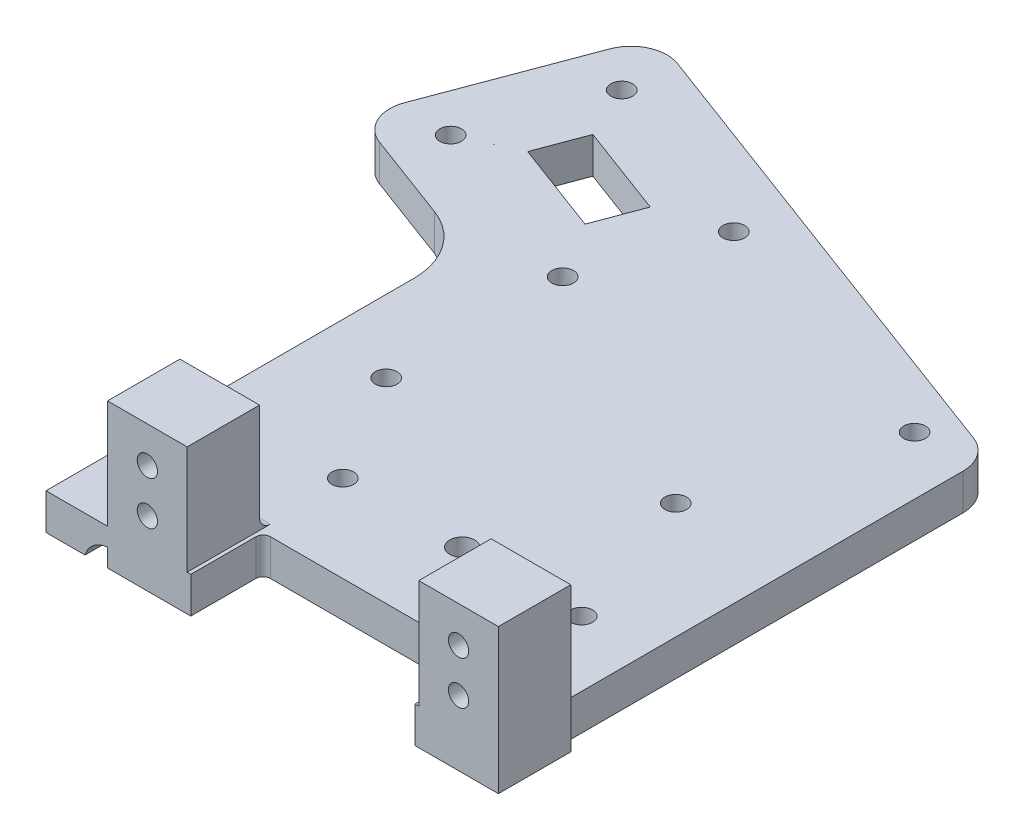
ISO-10303-21;
HEADER;
FILE_DESCRIPTION(('STEP AP214'),'2;1');
FILE_NAME('part.step','',(''),(''),'','','');
FILE_SCHEMA(('AUTOMOTIVE_DESIGN { 1 0 10303 214 1 1 1 1 }'));
ENDSEC;
DATA;
#1=APPLICATION_CONTEXT('core data for automotive mechanical design processes');
#2=APPLICATION_PROTOCOL_DEFINITION('international standard','automotive_design',2000,#1);
#3=PRODUCT_CONTEXT('',#1,'mechanical');
#4=PRODUCT('Part','Part','',(#3));
#5=PRODUCT_RELATED_PRODUCT_CATEGORY('part','',(#4));
#6=PRODUCT_DEFINITION_FORMATION('','',#4);
#7=PRODUCT_DEFINITION_CONTEXT('part definition',#1,'design');
#8=PRODUCT_DEFINITION('design','',#6,#7);
#9=PRODUCT_DEFINITION_SHAPE('','',#8);
#10=(LENGTH_UNIT() NAMED_UNIT(*) SI_UNIT(.MILLI.,.METRE.));
#11=(NAMED_UNIT(*) PLANE_ANGLE_UNIT() SI_UNIT($,.RADIAN.));
#12=(NAMED_UNIT(*) SI_UNIT($,.STERADIAN.) SOLID_ANGLE_UNIT());
#13=UNCERTAINTY_MEASURE_WITH_UNIT(LENGTH_MEASURE(1.E-05),#10,'distance_accuracy_value','');
#14=(GEOMETRIC_REPRESENTATION_CONTEXT(3) GLOBAL_UNCERTAINTY_ASSIGNED_CONTEXT((#13)) GLOBAL_UNIT_ASSIGNED_CONTEXT((#10,
#11,#12)) REPRESENTATION_CONTEXT('',''));
#15=CARTESIAN_POINT('',(0.,0.,0.));
#16=DIRECTION('',(0.,0.,1.));
#17=DIRECTION('',(1.,0.,0.));
#18=AXIS2_PLACEMENT_3D('',#15,#16,#17);
#19=CARTESIAN_POINT('',(0.,0.,-17.));
#20=DIRECTION('',(0.,0.,-1.));
#21=DIRECTION('',(-1.,0.,0.));
#22=AXIS2_PLACEMENT_3D('',#19,#20,#21);
#23=PLANE('',#22);
#24=CARTESIAN_POINT('',(85.25,2.,-17.));
#25=DIRECTION('',(0.,0.,-1.));
#26=DIRECTION('',(-1.,0.,0.));
#27=AXIS2_PLACEMENT_3D('',#24,#25,#26);
#28=CIRCLE('',#27,1.4);
#29=CARTESIAN_POINT('',(83.85,2.,-17.));
#30=VERTEX_POINT('',#29);
#31=EDGE_CURVE('E616',#30,#30,#28,.F.);
#32=ORIENTED_EDGE('',*,*,#31,.F.);
#33=EDGE_LOOP('',(#32));
#34=FACE_BOUND('',#33,.T.);
#35=DIRECTION('',(-1.,0.,0.));
#36=VECTOR('',#35,1.);
#37=CARTESIAN_POINT('',(68.25,-2.,-17.));
#38=LINE('',#37,#36);
#39=CARTESIAN_POINT('',(79.75,-2.,-17.));
#40=VERTEX_POINT('',#39);
#41=CARTESIAN_POINT('',(79.25,-2.,-17.));
#42=VERTEX_POINT('',#41);
#43=EDGE_CURVE('E611',#40,#42,#38,.T.);
#44=ORIENTED_EDGE('',*,*,#43,.T.);
#45=DIRECTION('',(0.,-1.,0.));
#46=VECTOR('',#45,1.);
#47=CARTESIAN_POINT('',(79.25,-7.,-17.));
#48=LINE('',#47,#46);
#49=CARTESIAN_POINT('',(79.25,-7.,-17.));
#50=VERTEX_POINT('',#49);
#51=EDGE_CURVE('E11',#42,#50,#48,.T.);
#52=ORIENTED_EDGE('',*,*,#51,.T.);
#53=DIRECTION('',(1.,0.,0.));
#54=VECTOR('',#53,1.);
#55=CARTESIAN_POINT('',(74.13,-7.,-17.));
#56=LINE('',#55,#54);
#57=CARTESIAN_POINT('',(90.75,-7.,-17.));
#58=VERTEX_POINT('',#57);
#59=EDGE_CURVE('E66',#50,#58,#56,.T.);
#60=ORIENTED_EDGE('',*,*,#59,.T.);
#61=DIRECTION('',(0.,-1.,0.));
#62=VECTOR('',#61,1.);
#63=CARTESIAN_POINT('',(90.75,-1.38396619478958E-13,-17.));
#64=LINE('',#63,#62);
#65=CARTESIAN_POINT('',(90.75,13.,-17.));
#66=VERTEX_POINT('',#65);
#67=EDGE_CURVE('E607',#66,#58,#64,.T.);
#68=ORIENTED_EDGE('',*,*,#67,.F.);
#69=DIRECTION('',(-1.,0.,0.));
#70=VECTOR('',#69,1.);
#71=CARTESIAN_POINT('',(0.,13.,-17.));
#72=LINE('',#71,#70);
#73=CARTESIAN_POINT('',(79.75,13.,-17.));
#74=VERTEX_POINT('',#73);
#75=EDGE_CURVE('E623',#66,#74,#72,.T.);
#76=ORIENTED_EDGE('',*,*,#75,.T.);
#77=DIRECTION('',(0.,-1.,0.));
#78=VECTOR('',#77,1.);
#79=CARTESIAN_POINT('',(79.75,0.,-17.));
#80=LINE('',#79,#78);
#81=EDGE_CURVE('E629',#74,#40,#80,.T.);
#82=ORIENTED_EDGE('',*,*,#81,.T.);
#83=EDGE_LOOP('',(#44,#52,#60,#68,#76,#82));
#84=FACE_BOUND('',#83,.T.);
#85=CARTESIAN_POINT('',(85.25,8.,-17.));
#86=DIRECTION('',(0.,0.,-1.));
#87=DIRECTION('',(-1.,0.,0.));
#88=AXIS2_PLACEMENT_3D('',#85,#86,#87);
#89=CIRCLE('',#88,1.4);
#90=CARTESIAN_POINT('',(83.85,8.,-17.));
#91=VERTEX_POINT('',#90);
#92=EDGE_CURVE('E625',#91,#91,#89,.F.);
#93=ORIENTED_EDGE('',*,*,#92,.F.);
#94=EDGE_LOOP('',(#93));
#95=FACE_BOUND('',#94,.T.);
#96=ADVANCED_FACE('F41',(#34,#84,#95),#23,.F.);
#97=CARTESIAN_POINT('',(0.,0.,-27.));
#98=DIRECTION('',(0.,0.,-1.));
#99=DIRECTION('',(-1.,0.,0.));
#100=AXIS2_PLACEMENT_3D('',#97,#98,#99);
#101=PLANE('',#100);
#102=CARTESIAN_POINT('',(42.25,2.,-27.));
#103=DIRECTION('',(0.,0.,-1.));
#104=DIRECTION('',(-1.,0.,0.));
#105=AXIS2_PLACEMENT_3D('',#102,#103,#104);
#106=CIRCLE('',#105,1.4);
#107=CARTESIAN_POINT('',(40.85,2.,-27.));
#108=VERTEX_POINT('',#107);
#109=EDGE_CURVE('E348',#108,#108,#106,.T.);
#110=ORIENTED_EDGE('',*,*,#109,.F.);
#111=EDGE_LOOP('',(#110));
#112=FACE_BOUND('',#111,.T.);
#113=DIRECTION('',(0.,-1.,0.));
#114=VECTOR('',#113,1.);
#115=CARTESIAN_POINT('',(47.75,13.,-27.));
#116=LINE('',#115,#114);
#117=CARTESIAN_POINT('',(47.75,13.,-27.));
#118=VERTEX_POINT('',#117);
#119=CARTESIAN_POINT('',(47.75,-0.500000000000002,-27.));
#120=VERTEX_POINT('',#119);
#121=EDGE_CURVE('E306',#118,#120,#116,.T.);
#122=ORIENTED_EDGE('',*,*,#121,.T.);
#123=DIRECTION('',(-1.,0.,0.));
#124=VECTOR('',#123,1.);
#125=CARTESIAN_POINT('',(36.75,-0.500000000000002,-27.));
#126=LINE('',#125,#124);
#127=CARTESIAN_POINT('',(36.75,-0.500000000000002,-27.));
#128=VERTEX_POINT('',#127);
#129=EDGE_CURVE('E301',#120,#128,#126,.T.);
#130=ORIENTED_EDGE('',*,*,#129,.T.);
#131=DIRECTION('',(0.,1.,0.));
#132=VECTOR('',#131,1.);
#133=CARTESIAN_POINT('',(36.75,-7.,-27.));
#134=LINE('',#133,#132);
#135=CARTESIAN_POINT('',(36.75,13.,-27.));
#136=VERTEX_POINT('',#135);
#137=EDGE_CURVE('E283',#128,#136,#134,.T.);
#138=ORIENTED_EDGE('',*,*,#137,.T.);
#139=DIRECTION('',(1.,0.,0.));
#140=VECTOR('',#139,1.);
#141=CARTESIAN_POINT('',(36.75,13.,-27.));
#142=LINE('',#141,#140);
#143=EDGE_CURVE('E298',#136,#118,#142,.T.);
#144=ORIENTED_EDGE('',*,*,#143,.T.);
#145=EDGE_LOOP('',(#122,#130,#138,#144));
#146=FACE_BOUND('',#145,.T.);
#147=CARTESIAN_POINT('',(42.25,8.,-27.));
#148=DIRECTION('',(0.,0.,-1.));
#149=DIRECTION('',(-1.,0.,0.));
#150=AXIS2_PLACEMENT_3D('',#147,#148,#149);
#151=CIRCLE('',#150,1.4);
#152=CARTESIAN_POINT('',(40.85,8.,-27.));
#153=VERTEX_POINT('',#152);
#154=EDGE_CURVE('E302',#153,#153,#151,.T.);
#155=ORIENTED_EDGE('',*,*,#154,.F.);
#156=EDGE_LOOP('',(#155));
#157=FACE_BOUND('',#156,.T.);
#158=ADVANCED_FACE('F296',(#112,#146,#157),#101,.T.);
#159=CARTESIAN_POINT('',(0.,13.,18.8254244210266));
#160=DIRECTION('',(0.,-1.,0.));
#161=DIRECTION('',(0.,0.,-1.));
#162=AXIS2_PLACEMENT_3D('',#159,#160,#161);
#163=PLANE('',#162);
#164=DIRECTION('',(0.,0.,-1.));
#165=VECTOR('',#164,1.);
#166=CARTESIAN_POINT('',(36.75,13.,18.8254244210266));
#167=LINE('',#166,#165);
#168=CARTESIAN_POINT('',(36.75,13.,-17.));
#169=VERTEX_POINT('',#168);
#170=EDGE_CURVE('E278',#169,#136,#167,.T.);
#171=ORIENTED_EDGE('',*,*,#170,.F.);
#172=DIRECTION('',(1.,0.,0.));
#173=VECTOR('',#172,1.);
#174=CARTESIAN_POINT('',(0.,13.,-17.));
#175=LINE('',#174,#173);
#176=CARTESIAN_POINT('',(47.75,13.,-17.));
#177=VERTEX_POINT('',#176);
#178=EDGE_CURVE('E614',#169,#177,#175,.T.);
#179=ORIENTED_EDGE('',*,*,#178,.T.);
#180=DIRECTION('',(0.,0.,-1.));
#181=VECTOR('',#180,1.);
#182=CARTESIAN_POINT('',(47.75,13.,18.8254244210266));
#183=LINE('',#182,#181);
#184=EDGE_CURVE('E289',#177,#118,#183,.T.);
#185=ORIENTED_EDGE('',*,*,#184,.T.);
#186=ORIENTED_EDGE('',*,*,#143,.F.);
#187=EDGE_LOOP('',(#171,#179,#185,#186));
#188=FACE_BOUND('',#187,.T.);
#189=ADVANCED_FACE('F304',(#188),#163,.F.);
#190=CARTESIAN_POINT('',(37.,-8.,-22.));
#191=DIRECTION('',(0.,0.,1.));
#192=DIRECTION('',(1.,0.,0.));
#193=AXIS2_PLACEMENT_3D('',#190,#191,#192);
#194=CYLINDRICAL_SURFACE('',#193,3.5);
#195=CARTESIAN_POINT('',(37.,-8.,-17.));
#196=DIRECTION('',(0.,0.,-1.));
#197=DIRECTION('',(-1.,0.,0.));
#198=AXIS2_PLACEMENT_3D('',#195,#196,#197);
#199=CIRCLE('',#198,3.5);
#200=CARTESIAN_POINT('',(33.6458980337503,-7.,-17.));
#201=VERTEX_POINT('',#200);
#202=CARTESIAN_POINT('',(36.75,-4.50893998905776,-17.));
#203=VERTEX_POINT('',#202);
#204=EDGE_CURVE('E58',#201,#203,#199,.T.);
#205=ORIENTED_EDGE('',*,*,#204,.F.);
#206=DIRECTION('',(0.,0.,1.));
#207=VECTOR('',#206,1.);
#208=CARTESIAN_POINT('',(33.6458980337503,-7.,-22.));
#209=LINE('',#208,#207);
#210=CARTESIAN_POINT('',(33.6458980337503,-7.,-22.));
#211=VERTEX_POINT('',#210);
#212=EDGE_CURVE('E354',#201,#211,#209,.F.);
#213=ORIENTED_EDGE('',*,*,#212,.T.);
#214=CARTESIAN_POINT('',(37.,-8.,-22.));
#215=DIRECTION('',(0.,0.,-1.));
#216=DIRECTION('',(-1.,0.,0.));
#217=AXIS2_PLACEMENT_3D('',#214,#215,#216);
#218=CIRCLE('',#217,3.5);
#219=CARTESIAN_POINT('',(36.75,-4.50893998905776,-22.));
#220=VERTEX_POINT('',#219);
#221=EDGE_CURVE('E432',#211,#220,#218,.T.);
#222=ORIENTED_EDGE('',*,*,#221,.T.);
#223=DIRECTION('',(0.,0.,1.));
#224=VECTOR('',#223,1.);
#225=CARTESIAN_POINT('',(36.75,-4.50893998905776,-22.));
#226=LINE('',#225,#224);
#227=EDGE_CURVE('E589',#220,#203,#226,.T.);
#228=ORIENTED_EDGE('',*,*,#227,.T.);
#229=EDGE_LOOP('',(#205,#213,#222,#228));
#230=FACE_BOUND('',#229,.T.);
#231=ADVANCED_FACE('F43',(#230),#194,.F.);
#232=CARTESIAN_POINT('',(44.7630327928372,-7.,-95.5033464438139));
#233=DIRECTION('',(0.,1.,0.));
#234=DIRECTION('',(0.,0.,1.));
#235=AXIS2_PLACEMENT_3D('',#232,#233,#234);
#236=CYLINDRICAL_SURFACE('',#235,1.5);
#237=CARTESIAN_POINT('',(44.7630327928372,-7.,-95.5033464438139));
#238=DIRECTION('',(0.,1.,0.));
#239=DIRECTION('',(0.,0.,1.));
#240=AXIS2_PLACEMENT_3D('',#237,#238,#239);
#241=CIRCLE('',#240,1.5);
#242=CARTESIAN_POINT('',(44.7630327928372,-7.,-94.0033464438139));
#243=VERTEX_POINT('',#242);
#244=EDGE_CURVE('E502',#243,#243,#241,.F.);
#245=ORIENTED_EDGE('',*,*,#244,.T.);
#246=EDGE_LOOP('',(#245));
#247=FACE_BOUND('',#246,.T.);
#248=CARTESIAN_POINT('',(44.7630327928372,-2.,-95.5033464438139));
#249=DIRECTION('',(0.,1.,0.));
#250=DIRECTION('',(0.,0.,1.));
#251=AXIS2_PLACEMENT_3D('',#248,#249,#250);
#252=CIRCLE('',#251,1.5);
#253=CARTESIAN_POINT('',(44.7630327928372,-2.,-94.0033464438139));
#254=VERTEX_POINT('',#253);
#255=EDGE_CURVE('E367',#254,#254,#252,.T.);
#256=ORIENTED_EDGE('',*,*,#255,.T.);
#257=EDGE_LOOP('',(#256));
#258=FACE_BOUND('',#257,.T.);
#259=ADVANCED_FACE('F726',(#247,#258),#236,.F.);
#260=CARTESIAN_POINT('',(38.3383677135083,-7.,-78.2886005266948));
#261=DIRECTION('',(0.,1.,0.));
#262=DIRECTION('',(0.,0.,1.));
#263=AXIS2_PLACEMENT_3D('',#260,#261,#262);
#264=CYLINDRICAL_SURFACE('',#263,1.5);
#265=CARTESIAN_POINT('',(38.3383677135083,-7.,-78.2886005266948));
#266=DIRECTION('',(0.,1.,0.));
#267=DIRECTION('',(0.,0.,1.));
#268=AXIS2_PLACEMENT_3D('',#265,#266,#267);
#269=CIRCLE('',#268,1.5);
#270=CARTESIAN_POINT('',(38.3383677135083,-7.,-76.7886005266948));
#271=VERTEX_POINT('',#270);
#272=EDGE_CURVE('E379',#271,#271,#269,.T.);
#273=ORIENTED_EDGE('',*,*,#272,.F.);
#274=EDGE_LOOP('',(#273));
#275=FACE_BOUND('',#274,.T.);
#276=CARTESIAN_POINT('',(38.3383677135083,-2.,-78.2886005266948));
#277=DIRECTION('',(0.,1.,0.));
#278=DIRECTION('',(0.,0.,1.));
#279=AXIS2_PLACEMENT_3D('',#276,#277,#278);
#280=CIRCLE('',#279,1.5);
#281=CARTESIAN_POINT('',(38.3383677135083,-2.,-76.7886005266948));
#282=VERTEX_POINT('',#281);
#283=EDGE_CURVE('E408',#282,#282,#280,.F.);
#284=ORIENTED_EDGE('',*,*,#283,.F.);
#285=EDGE_LOOP('',(#284));
#286=FACE_BOUND('',#285,.T.);
#287=ADVANCED_FACE('F729',(#275,#286),#264,.F.);
#288=CARTESIAN_POINT('',(-13.858801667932,-7.,-5.19853451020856));
#289=DIRECTION('',(-0.936296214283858,0.,-0.351211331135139));
#290=DIRECTION('',(-0.351211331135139,0.,0.936296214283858));
#291=AXIS2_PLACEMENT_3D('',#288,#289,#290);
#292=PLANE('',#291);
#293=DIRECTION('',(0.351211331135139,0.,-0.936296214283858));
#294=VECTOR('',#293,1.);
#295=CARTESIAN_POINT('',(-13.858801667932,-2.,-5.19853451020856));
#296=LINE('',#295,#294);
#297=CARTESIAN_POINT('',(17.7202960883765,-2.,-89.3854244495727));
#298=VERTEX_POINT('',#297);
#299=CARTESIAN_POINT('',(17.7272418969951,-2.,-89.4039413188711));
#300=VERTEX_POINT('',#299);
#301=EDGE_CURVE('E392',#298,#300,#296,.T.);
#302=ORIENTED_EDGE('',*,*,#301,.F.);
#303=DIRECTION('',(0.,1.,0.));
#304=VECTOR('',#303,1.);
#305=CARTESIAN_POINT('',(17.7202960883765,-7.,-89.3854244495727));
#306=LINE('',#305,#304);
#307=CARTESIAN_POINT('',(17.7202960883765,-7.,-89.3854244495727));
#308=VERTEX_POINT('',#307);
#309=EDGE_CURVE('E389',#308,#298,#306,.T.);
#310=ORIENTED_EDGE('',*,*,#309,.F.);
#311=DIRECTION('',(-0.351211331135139,0.,0.936296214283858));
#312=VECTOR('',#311,1.);
#313=CARTESIAN_POINT('',(-13.858801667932,-7.,-5.19853451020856));
#314=LINE('',#313,#312);
#315=CARTESIAN_POINT('',(17.7272418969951,-7.,-89.4039413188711));
#316=VERTEX_POINT('',#315);
#317=EDGE_CURVE('E448',#316,#308,#314,.T.);
#318=ORIENTED_EDGE('',*,*,#317,.F.);
#319=DIRECTION('',(0.,1.,0.));
#320=VECTOR('',#319,1.);
#321=CARTESIAN_POINT('',(17.7272418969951,-7.,-89.4039413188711));
#322=LINE('',#321,#320);
#323=EDGE_CURVE('E385',#316,#300,#322,.T.);
#324=ORIENTED_EDGE('',*,*,#323,.T.);
#325=EDGE_LOOP('',(#302,#310,#318,#324));
#326=FACE_BOUND('',#325,.T.);
#327=ADVANCED_FACE('F743',(#326),#292,.F.);
#328=CARTESIAN_POINT('',(31.4473244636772,-7.,-84.2624002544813));
#329=DIRECTION('',(-0.349650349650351,0.,0.936880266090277));
#330=DIRECTION('',(0.936880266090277,0.,0.349650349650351));
#331=AXIS2_PLACEMENT_3D('',#328,#329,#330);
#332=PLANE('',#331);
#333=DIRECTION('',(-0.936880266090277,0.,-0.349650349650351));
#334=VECTOR('',#333,1.);
#335=CARTESIAN_POINT('',(31.4473244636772,-2.,-84.2624002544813));
#336=LINE('',#335,#334);
#337=CARTESIAN_POINT('',(17.7390336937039,-2.,-89.3784314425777));
#338=VERTEX_POINT('',#337);
#339=EDGE_CURVE('E396',#338,#298,#336,.T.);
#340=ORIENTED_EDGE('',*,*,#339,.F.);
#341=DIRECTION('',(0.,1.,0.));
#342=VECTOR('',#341,1.);
#343=CARTESIAN_POINT('',(17.7390336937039,-7.,-89.3784314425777));
#344=LINE('',#343,#342);
#345=CARTESIAN_POINT('',(17.7390336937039,-7.,-89.3784314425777));
#346=VERTEX_POINT('',#345);
#347=EDGE_CURVE('E387',#346,#338,#344,.T.);
#348=ORIENTED_EDGE('',*,*,#347,.F.);
#349=DIRECTION('',(0.936880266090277,0.,0.349650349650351));
#350=VECTOR('',#349,1.);
#351=CARTESIAN_POINT('',(31.4473244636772,-7.,-84.2624002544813));
#352=LINE('',#351,#350);
#353=EDGE_CURVE('E454',#308,#346,#352,.T.);
#354=ORIENTED_EDGE('',*,*,#353,.F.);
#355=ORIENTED_EDGE('',*,*,#309,.T.);
#356=EDGE_LOOP('',(#340,#348,#354,#355));
#357=FACE_BOUND('',#356,.T.);
#358=ADVANCED_FACE('F760',(#357),#332,.F.);
#359=CARTESIAN_POINT('',(13.6484382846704,-7.,-87.5030570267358));
#360=DIRECTION('',(0.,1.,0.));
#361=DIRECTION('',(0.,0.,1.));
#362=AXIS2_PLACEMENT_3D('',#359,#360,#361);
#363=CYLINDRICAL_SURFACE('',#362,4.50000000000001);
#364=ORIENTED_EDGE('',*,*,#347,.T.);
#365=CARTESIAN_POINT('',(13.6484382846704,-2.,-87.5030570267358));
#366=DIRECTION('',(0.,1.,0.));
#367=DIRECTION('',(0.,0.,1.));
#368=AXIS2_PLACEMENT_3D('',#365,#366,#367);
#369=CIRCLE('',#368,4.50000000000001);
#370=EDGE_CURVE('E366',#338,#300,#369,.T.);
#371=ORIENTED_EDGE('',*,*,#370,.T.);
#372=ORIENTED_EDGE('',*,*,#323,.F.);
#373=CARTESIAN_POINT('',(13.6484382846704,-7.,-87.5030570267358));
#374=DIRECTION('',(0.,1.,0.));
#375=DIRECTION('',(0.,0.,1.));
#376=AXIS2_PLACEMENT_3D('',#373,#374,#375);
#377=CIRCLE('',#376,4.50000000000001);
#378=EDGE_CURVE('E451',#316,#346,#377,.F.);
#379=ORIENTED_EDGE('',*,*,#378,.T.);
#380=EDGE_LOOP('',(#364,#371,#372,#379));
#381=FACE_BOUND('',#380,.T.);
#382=ADVANCED_FACE('F753',(#381),#363,.F.);
#383=CARTESIAN_POINT('',(-11.5180611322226,-7.,-4.32050618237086));
#384=DIRECTION('',(-0.936296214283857,0.,-0.351211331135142));
#385=DIRECTION('',(-0.351211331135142,0.,0.936296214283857));
#386=AXIS2_PLACEMENT_3D('',#383,#384,#385);
#387=PLANE('',#386);
#388=DIRECTION('',(0.351211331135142,0.,-0.936296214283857));
#389=VECTOR('',#388,1.);
#390=CARTESIAN_POINT('',(-11.5180611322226,-2.,-4.32050618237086));
#391=LINE('',#390,#389);
#392=CARTESIAN_POINT('',(20.9405295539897,-2.,-90.8520411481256));
#393=VERTEX_POINT('',#392);
#394=CARTESIAN_POINT('',(23.399006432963,-2.,-97.4061081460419));
#395=VERTEX_POINT('',#394);
#396=EDGE_CURVE('E402',#393,#395,#391,.T.);
#397=ORIENTED_EDGE('',*,*,#396,.F.);
#398=DIRECTION('',(0.,1.,0.));
#399=VECTOR('',#398,1.);
#400=CARTESIAN_POINT('',(20.9405295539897,-7.,-90.8520411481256));
#401=LINE('',#400,#399);
#402=CARTESIAN_POINT('',(20.9405295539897,-7.,-90.8520411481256));
#403=VERTEX_POINT('',#402);
#404=EDGE_CURVE('E381',#403,#393,#401,.T.);
#405=ORIENTED_EDGE('',*,*,#404,.F.);
#406=DIRECTION('',(-0.351211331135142,0.,0.936296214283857));
#407=VECTOR('',#406,1.);
#408=CARTESIAN_POINT('',(-11.5180611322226,-7.,-4.32050618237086));
#409=LINE('',#408,#407);
#410=CARTESIAN_POINT('',(23.399006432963,-7.,-97.4061081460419));
#411=VERTEX_POINT('',#410);
#412=EDGE_CURVE('E446',#411,#403,#409,.T.);
#413=ORIENTED_EDGE('',*,*,#412,.F.);
#414=DIRECTION('',(0.,1.,0.));
#415=VECTOR('',#414,1.);
#416=CARTESIAN_POINT('',(23.399006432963,-7.,-97.4061081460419));
#417=LINE('',#416,#415);
#418=EDGE_CURVE('E383',#411,#395,#417,.T.);
#419=ORIENTED_EDGE('',*,*,#418,.T.);
#420=EDGE_LOOP('',(#397,#405,#413,#419));
#421=FACE_BOUND('',#420,.T.);
#422=ADVANCED_FACE('F749',(#421),#387,.F.);
#423=CARTESIAN_POINT('',(32.3214503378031,-7.,-86.604600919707));
#424=DIRECTION('',(-0.34965034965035,0.,0.936880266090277));
#425=DIRECTION('',(0.936880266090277,0.,0.34965034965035));
#426=AXIS2_PLACEMENT_3D('',#423,#424,#425);
#427=PLANE('',#426);
#428=DIRECTION('',(-0.936880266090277,0.,-0.34965034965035));
#429=VECTOR('',#428,1.);
#430=CARTESIAN_POINT('',(32.3214503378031,-2.,-86.604600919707));
#431=LINE('',#430,#429);
#432=CARTESIAN_POINT('',(33.5884046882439,-2.,-86.1317645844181));
#433=VERTEX_POINT('',#432);
#434=EDGE_CURVE('E405',#433,#393,#431,.T.);
#435=ORIENTED_EDGE('',*,*,#434,.F.);
#436=DIRECTION('',(0.,1.,0.));
#437=VECTOR('',#436,1.);
#438=CARTESIAN_POINT('',(33.5884046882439,-7.,-86.1317645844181));
#439=LINE('',#438,#437);
#440=CARTESIAN_POINT('',(33.5884046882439,-7.,-86.1317645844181));
#441=VERTEX_POINT('',#440);
#442=EDGE_CURVE('E378',#441,#433,#439,.T.);
#443=ORIENTED_EDGE('',*,*,#442,.F.);
#444=DIRECTION('',(0.936880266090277,0.,0.34965034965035));
#445=VECTOR('',#444,1.);
#446=CARTESIAN_POINT('',(32.3214503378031,-7.,-86.604600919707));
#447=LINE('',#446,#445);
#448=EDGE_CURVE('E444',#403,#441,#447,.T.);
#449=ORIENTED_EDGE('',*,*,#448,.F.);
#450=ORIENTED_EDGE('',*,*,#404,.T.);
#451=EDGE_LOOP('',(#435,#443,#449,#450));
#452=FACE_BOUND('',#451,.T.);
#453=ADVANCED_FACE('F752',(#452),#427,.F.);
#454=CARTESIAN_POINT('',(1.1219117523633,-7.,0.420837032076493));
#455=DIRECTION('',(0.936296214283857,0.,0.351211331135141));
#456=DIRECTION('',(0.351211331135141,0.,-0.936296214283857));
#457=AXIS2_PLACEMENT_3D('',#454,#455,#456);
#458=PLANE('',#457);
#459=DIRECTION('',(-0.351211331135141,0.,0.936296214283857));
#460=VECTOR('',#459,1.);
#461=CARTESIAN_POINT('',(1.1219117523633,-2.,0.420837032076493));
#462=LINE('',#461,#460);
#463=CARTESIAN_POINT('',(36.0468815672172,-2.,-92.6858315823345));
#464=VERTEX_POINT('',#463);
#465=EDGE_CURVE('E371',#464,#433,#462,.T.);
#466=ORIENTED_EDGE('',*,*,#465,.F.);
#467=DIRECTION('',(0.,1.,0.));
#468=VECTOR('',#467,1.);
#469=CARTESIAN_POINT('',(36.0468815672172,-7.,-92.6858315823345));
#470=LINE('',#469,#468);
#471=CARTESIAN_POINT('',(36.0468815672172,-7.,-92.6858315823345));
#472=VERTEX_POINT('',#471);
#473=EDGE_CURVE('E376',#472,#464,#470,.T.);
#474=ORIENTED_EDGE('',*,*,#473,.F.);
#475=DIRECTION('',(0.351211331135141,0.,-0.936296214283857));
#476=VECTOR('',#475,1.);
#477=CARTESIAN_POINT('',(1.1219117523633,-7.,0.420837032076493));
#478=LINE('',#477,#476);
#479=EDGE_CURVE('E441',#441,#472,#478,.T.);
#480=ORIENTED_EDGE('',*,*,#479,.F.);
#481=ORIENTED_EDGE('',*,*,#442,.T.);
#482=EDGE_LOOP('',(#466,#474,#480,#481));
#483=FACE_BOUND('',#482,.T.);
#484=ADVANCED_FACE('F747',(#483),#458,.F.);
#485=CARTESIAN_POINT('',(34.7689969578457,-7.,-93.162747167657));
#486=DIRECTION('',(0.349650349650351,0.,-0.936880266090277));
#487=DIRECTION('',(-0.936880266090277,0.,-0.349650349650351));
#488=AXIS2_PLACEMENT_3D('',#485,#486,#487);
#489=PLANE('',#488);
#490=DIRECTION('',(0.936880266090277,0.,0.349650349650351));
#491=VECTOR('',#490,1.);
#492=CARTESIAN_POINT('',(34.7689969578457,-2.,-93.162747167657));
#493=LINE('',#492,#491);
#494=EDGE_CURVE('E399',#395,#464,#493,.T.);
#495=ORIENTED_EDGE('',*,*,#494,.F.);
#496=ORIENTED_EDGE('',*,*,#418,.F.);
#497=DIRECTION('',(-0.936880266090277,0.,-0.349650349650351));
#498=VECTOR('',#497,1.);
#499=CARTESIAN_POINT('',(34.7689969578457,-7.,-93.162747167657));
#500=LINE('',#499,#498);
#501=EDGE_CURVE('E438',#472,#411,#500,.T.);
#502=ORIENTED_EDGE('',*,*,#501,.F.);
#503=ORIENTED_EDGE('',*,*,#473,.T.);
#504=EDGE_LOOP('',(#495,#496,#502,#503));
#505=FACE_BOUND('',#504,.T.);
#506=ADVANCED_FACE('F739',(#505),#489,.F.);
#507=CARTESIAN_POINT('',(13.6484382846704,-7.,-87.5030570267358));
#508=DIRECTION('',(0.,1.,0.));
#509=DIRECTION('',(0.,0.,1.));
#510=AXIS2_PLACEMENT_3D('',#507,#508,#509);
#511=CYLINDRICAL_SURFACE('',#510,1.5);
#512=CARTESIAN_POINT('',(13.6484382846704,-7.,-87.5030570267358));
#513=DIRECTION('',(0.,1.,0.));
#514=DIRECTION('',(0.,0.,1.));
#515=AXIS2_PLACEMENT_3D('',#512,#513,#514);
#516=CIRCLE('',#515,1.5);
#517=CARTESIAN_POINT('',(13.6484382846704,-7.,-86.0030570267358));
#518=VERTEX_POINT('',#517);
#519=EDGE_CURVE('E508',#518,#518,#516,.F.);
#520=ORIENTED_EDGE('',*,*,#519,.T.);
#521=EDGE_LOOP('',(#520));
#522=FACE_BOUND('',#521,.T.);
#523=CARTESIAN_POINT('',(13.6484382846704,-2.,-87.5030570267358));
#524=DIRECTION('',(0.,1.,0.));
#525=DIRECTION('',(0.,0.,1.));
#526=AXIS2_PLACEMENT_3D('',#523,#524,#525);
#527=CIRCLE('',#526,1.5);
#528=CARTESIAN_POINT('',(13.6484382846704,-2.,-86.0030570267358));
#529=VERTEX_POINT('',#528);
#530=EDGE_CURVE('E419',#529,#529,#527,.T.);
#531=ORIENTED_EDGE('',*,*,#530,.T.);
#532=EDGE_LOOP('',(#531));
#533=FACE_BOUND('',#532,.T.);
#534=ADVANCED_FACE('F735',(#522,#533),#511,.F.);
#535=CARTESIAN_POINT('',(20.0731033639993,-7.,-104.717802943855));
#536=DIRECTION('',(0.,1.,0.));
#537=DIRECTION('',(0.,0.,1.));
#538=AXIS2_PLACEMENT_3D('',#535,#536,#537);
#539=CYLINDRICAL_SURFACE('',#538,1.5);
#540=CARTESIAN_POINT('',(20.0731033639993,-7.,-104.717802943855));
#541=DIRECTION('',(0.,1.,0.));
#542=DIRECTION('',(0.,0.,1.));
#543=AXIS2_PLACEMENT_3D('',#540,#541,#542);
#544=CIRCLE('',#543,1.5);
#545=CARTESIAN_POINT('',(20.0731033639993,-7.,-103.217802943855));
#546=VERTEX_POINT('',#545);
#547=EDGE_CURVE('E505',#546,#546,#544,.T.);
#548=ORIENTED_EDGE('',*,*,#547,.F.);
#549=EDGE_LOOP('',(#548));
#550=FACE_BOUND('',#549,.T.);
#551=CARTESIAN_POINT('',(20.0731033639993,-2.,-104.717802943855));
#552=DIRECTION('',(0.,1.,0.));
#553=DIRECTION('',(0.,0.,1.));
#554=AXIS2_PLACEMENT_3D('',#551,#552,#553);
#555=CIRCLE('',#554,1.5);
#556=CARTESIAN_POINT('',(20.0731033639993,-2.,-103.217802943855));
#557=VERTEX_POINT('',#556);
#558=EDGE_CURVE('E375',#557,#557,#555,.F.);
#559=ORIENTED_EDGE('',*,*,#558,.F.);
#560=EDGE_LOOP('',(#559));
#561=FACE_BOUND('',#560,.T.);
#562=ADVANCED_FACE('F731',(#550,#561),#539,.F.);
#563=CARTESIAN_POINT('',(81.25,-7.,-84.));
#564=DIRECTION('',(0.,1.,0.));
#565=DIRECTION('',(0.,0.,1.));
#566=AXIS2_PLACEMENT_3D('',#563,#564,#565);
#567=CYLINDRICAL_SURFACE('',#566,1.5);
#568=CARTESIAN_POINT('',(81.25,-7.,-84.));
#569=DIRECTION('',(0.,1.,0.));
#570=DIRECTION('',(0.,0.,1.));
#571=AXIS2_PLACEMENT_3D('',#568,#569,#570);
#572=CIRCLE('',#571,1.5);
#573=CARTESIAN_POINT('',(81.25,-7.,-82.5));
#574=VERTEX_POINT('',#573);
#575=EDGE_CURVE('E499',#574,#574,#572,.T.);
#576=ORIENTED_EDGE('',*,*,#575,.F.);
#577=EDGE_LOOP('',(#576));
#578=FACE_BOUND('',#577,.T.);
#579=CARTESIAN_POINT('',(81.25,-2.,-84.));
#580=DIRECTION('',(0.,1.,0.));
#581=DIRECTION('',(0.,0.,1.));
#582=AXIS2_PLACEMENT_3D('',#579,#580,#581);
#583=CIRCLE('',#582,1.5);
#584=CARTESIAN_POINT('',(81.25,-2.,-82.5));
#585=VERTEX_POINT('',#584);
#586=EDGE_CURVE('E442',#585,#585,#583,.T.);
#587=ORIENTED_EDGE('',*,*,#586,.T.);
#588=EDGE_LOOP('',(#587));
#589=FACE_BOUND('',#588,.T.);
#590=ADVANCED_FACE('F734',(#578,#589),#567,.F.);
#591=CARTESIAN_POINT('',(38.25,-7.,-54.));
#592=DIRECTION('',(0.,1.,0.));
#593=DIRECTION('',(0.,0.,1.));
#594=AXIS2_PLACEMENT_3D('',#591,#592,#593);
#595=CYLINDRICAL_SURFACE('',#594,1.5);
#596=CARTESIAN_POINT('',(38.25,-7.,-54.));
#597=DIRECTION('',(0.,1.,0.));
#598=DIRECTION('',(0.,0.,1.));
#599=AXIS2_PLACEMENT_3D('',#596,#597,#598);
#600=CIRCLE('',#599,1.5);
#601=CARTESIAN_POINT('',(38.25,-7.,-52.5));
#602=VERTEX_POINT('',#601);
#603=EDGE_CURVE('E496',#602,#602,#600,.T.);
#604=ORIENTED_EDGE('',*,*,#603,.F.);
#605=EDGE_LOOP('',(#604));
#606=FACE_BOUND('',#605,.T.);
#607=CARTESIAN_POINT('',(38.25,-2.,-54.));
#608=DIRECTION('',(0.,1.,0.));
#609=DIRECTION('',(0.,0.,1.));
#610=AXIS2_PLACEMENT_3D('',#607,#608,#609);
#611=CIRCLE('',#610,1.5);
#612=CARTESIAN_POINT('',(38.25,-2.,-52.5));
#613=VERTEX_POINT('',#612);
#614=EDGE_CURVE('E555',#613,#613,#611,.T.);
#615=ORIENTED_EDGE('',*,*,#614,.T.);
#616=EDGE_LOOP('',(#615));
#617=FACE_BOUND('',#616,.T.);
#618=ADVANCED_FACE('F781',(#606,#617),#595,.F.);
#619=CARTESIAN_POINT('',(73.25,-7.,-59.));
#620=DIRECTION('',(0.,1.,0.));
#621=DIRECTION('',(0.,0.,1.));
#622=AXIS2_PLACEMENT_3D('',#619,#620,#621);
#623=CYLINDRICAL_SURFACE('',#622,1.5);
#624=CARTESIAN_POINT('',(73.25,-7.,-59.));
#625=DIRECTION('',(0.,1.,0.));
#626=DIRECTION('',(0.,0.,1.));
#627=AXIS2_PLACEMENT_3D('',#624,#625,#626);
#628=CIRCLE('',#627,1.5);
#629=CARTESIAN_POINT('',(73.25,-7.,-57.5));
#630=VERTEX_POINT('',#629);
#631=EDGE_CURVE('E493',#630,#630,#628,.T.);
#632=ORIENTED_EDGE('',*,*,#631,.F.);
#633=EDGE_LOOP('',(#632));
#634=FACE_BOUND('',#633,.T.);
#635=CARTESIAN_POINT('',(73.25,-2.,-59.));
#636=DIRECTION('',(0.,1.,0.));
#637=DIRECTION('',(0.,0.,1.));
#638=AXIS2_PLACEMENT_3D('',#635,#636,#637);
#639=CIRCLE('',#638,1.5);
#640=CARTESIAN_POINT('',(73.25,-2.,-57.5));
#641=VERTEX_POINT('',#640);
#642=EDGE_CURVE('E552',#641,#641,#639,.T.);
#643=ORIENTED_EDGE('',*,*,#642,.T.);
#644=EDGE_LOOP('',(#643));
#645=FACE_BOUND('',#644,.T.);
#646=ADVANCED_FACE('F785',(#634,#645),#623,.F.);
#647=CARTESIAN_POINT('',(47.25,-7.,-39.));
#648=DIRECTION('',(0.,1.,0.));
#649=DIRECTION('',(0.,0.,1.));
#650=AXIS2_PLACEMENT_3D('',#647,#648,#649);
#651=CYLINDRICAL_SURFACE('',#650,1.5);
#652=CARTESIAN_POINT('',(47.25,-2.,-39.));
#653=DIRECTION('',(0.,1.,0.));
#654=DIRECTION('',(0.,0.,1.));
#655=AXIS2_PLACEMENT_3D('',#652,#653,#654);
#656=CIRCLE('',#655,1.5);
#657=CARTESIAN_POINT('',(47.25,-2.,-37.5));
#658=VERTEX_POINT('',#657);
#659=EDGE_CURVE('E372',#658,#658,#656,.F.);
#660=ORIENTED_EDGE('',*,*,#659,.F.);
#661=EDGE_LOOP('',(#660));
#662=FACE_BOUND('',#661,.T.);
#663=CARTESIAN_POINT('',(47.25,-7.,-39.));
#664=DIRECTION('',(0.,-1.,0.));
#665=DIRECTION('',(0.,0.,-1.));
#666=AXIS2_PLACEMENT_3D('',#663,#664,#665);
#667=CIRCLE('',#666,1.5);
#668=CARTESIAN_POINT('',(47.25,-7.,-40.5));
#669=VERTEX_POINT('',#668);
#670=EDGE_CURVE('E597',#669,#669,#667,.F.);
#671=ORIENTED_EDGE('',*,*,#670,.F.);
#672=EDGE_LOOP('',(#671));
#673=FACE_BOUND('',#672,.T.);
#674=ADVANCED_FACE('F789',(#662,#673),#651,.F.);
#675=CARTESIAN_POINT('',(80.25,-7.,-39.));
#676=DIRECTION('',(0.,1.,0.));
#677=DIRECTION('',(0.,0.,1.));
#678=AXIS2_PLACEMENT_3D('',#675,#676,#677);
#679=CYLINDRICAL_SURFACE('',#678,1.50000000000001);
#680=CARTESIAN_POINT('',(80.25,-2.,-39.));
#681=DIRECTION('',(0.,1.,0.));
#682=DIRECTION('',(0.,0.,1.));
#683=AXIS2_PLACEMENT_3D('',#680,#681,#682);
#684=CIRCLE('',#683,1.50000000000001);
#685=CARTESIAN_POINT('',(80.25,-2.,-37.5));
#686=VERTEX_POINT('',#685);
#687=EDGE_CURVE('E363',#686,#686,#684,.T.);
#688=ORIENTED_EDGE('',*,*,#687,.T.);
#689=EDGE_LOOP('',(#688));
#690=FACE_BOUND('',#689,.T.);
#691=CARTESIAN_POINT('',(80.25,-7.,-39.));
#692=DIRECTION('',(0.,-1.,0.));
#693=DIRECTION('',(0.,0.,-1.));
#694=AXIS2_PLACEMENT_3D('',#691,#692,#693);
#695=CIRCLE('',#694,1.50000000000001);
#696=CARTESIAN_POINT('',(80.25,-7.,-40.5));
#697=VERTEX_POINT('',#696);
#698=EDGE_CURVE('E349',#697,#697,#695,.T.);
#699=ORIENTED_EDGE('',*,*,#698,.T.);
#700=EDGE_LOOP('',(#699));
#701=FACE_BOUND('',#700,.T.);
#702=ADVANCED_FACE('F843',(#690,#701),#679,.F.);
#703=CARTESIAN_POINT('',(63.75,-7.,-39.));
#704=DIRECTION('',(0.,1.,0.));
#705=DIRECTION('',(0.,0.,1.));
#706=AXIS2_PLACEMENT_3D('',#703,#704,#705);
#707=CYLINDRICAL_SURFACE('',#706,1.725);
#708=CARTESIAN_POINT('',(63.75,-2.,-39.));
#709=DIRECTION('',(0.,1.,0.));
#710=DIRECTION('',(0.,0.,1.));
#711=AXIS2_PLACEMENT_3D('',#708,#709,#710);
#712=CIRCLE('',#711,1.725);
#713=CARTESIAN_POINT('',(63.75,-2.,-37.275));
#714=VERTEX_POINT('',#713);
#715=EDGE_CURVE('E368',#714,#714,#712,.F.);
#716=ORIENTED_EDGE('',*,*,#715,.F.);
#717=EDGE_LOOP('',(#716));
#718=FACE_BOUND('',#717,.T.);
#719=CARTESIAN_POINT('',(63.75,-7.,-39.));
#720=DIRECTION('',(0.,-1.,0.));
#721=DIRECTION('',(0.,0.,-1.));
#722=AXIS2_PLACEMENT_3D('',#719,#720,#721);
#723=CIRCLE('',#722,1.725);
#724=CARTESIAN_POINT('',(63.75,-7.,-40.725));
#725=VERTEX_POINT('',#724);
#726=EDGE_CURVE('E602',#725,#725,#723,.F.);
#727=ORIENTED_EDGE('',*,*,#726,.F.);
#728=EDGE_LOOP('',(#727));
#729=FACE_BOUND('',#728,.T.);
#730=ADVANCED_FACE('F839',(#718,#729),#707,.F.);
#731=CARTESIAN_POINT('',(0.,-7.,-27.));
#732=DIRECTION('',(0.,0.,-1.));
#733=DIRECTION('',(-1.,0.,0.));
#734=AXIS2_PLACEMENT_3D('',#731,#732,#733);
#735=PLANE('',#734);
#736=DIRECTION('',(-1.,0.,0.));
#737=VECTOR('',#736,1.);
#738=CARTESIAN_POINT('',(0.,-7.,-27.));
#739=LINE('',#738,#737);
#740=CARTESIAN_POINT('',(78.25,-7.,-27.));
#741=VERTEX_POINT('',#740);
#742=CARTESIAN_POINT('',(49.25,-7.,-27.));
#743=VERTEX_POINT('',#742);
#744=EDGE_CURVE('E600',#741,#743,#739,.T.);
#745=ORIENTED_EDGE('',*,*,#744,.F.);
#746=DIRECTION('',(0.,1.,0.));
#747=VECTOR('',#746,1.);
#748=CARTESIAN_POINT('',(78.25,-7.,-27.));
#749=LINE('',#748,#747);
#750=CARTESIAN_POINT('',(78.25,-2.,-27.));
#751=VERTEX_POINT('',#750);
#752=EDGE_CURVE('E569',#741,#751,#749,.T.);
#753=ORIENTED_EDGE('',*,*,#752,.T.);
#754=DIRECTION('',(-1.,0.,0.));
#755=VECTOR('',#754,1.);
#756=CARTESIAN_POINT('',(0.,-2.,-27.));
#757=LINE('',#756,#755);
#758=CARTESIAN_POINT('',(49.25,-2.,-27.));
#759=VERTEX_POINT('',#758);
#760=EDGE_CURVE('E539',#751,#759,#757,.T.);
#761=ORIENTED_EDGE('',*,*,#760,.T.);
#762=DIRECTION('',(0.,1.,0.));
#763=VECTOR('',#762,1.);
#764=CARTESIAN_POINT('',(49.25,-7.,-27.));
#765=LINE('',#764,#763);
#766=EDGE_CURVE('E571',#743,#759,#765,.T.);
#767=ORIENTED_EDGE('',*,*,#766,.F.);
#768=EDGE_LOOP('',(#745,#753,#761,#767));
#769=FACE_BOUND('',#768,.T.);
#770=ADVANCED_FACE('F677',(#769),#735,.F.);
#771=CARTESIAN_POINT('',(47.75,0.,18.8254244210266));
#772=DIRECTION('',(-1.,0.,0.));
#773=DIRECTION('',(0.,0.,1.));
#774=AXIS2_PLACEMENT_3D('',#771,#772,#773);
#775=PLANE('',#774);
#776=ORIENTED_EDGE('',*,*,#184,.F.);
#777=DIRECTION('',(0.,-1.,0.));
#778=VECTOR('',#777,1.);
#779=CARTESIAN_POINT('',(47.75,0.,-17.));
#780=LINE('',#779,#778);
#781=CARTESIAN_POINT('',(47.75,-2.,-17.));
#782=VERTEX_POINT('',#781);
#783=EDGE_CURVE('E612',#177,#782,#780,.T.);
#784=ORIENTED_EDGE('',*,*,#783,.T.);
#785=DIRECTION('',(0.,0.,1.));
#786=VECTOR('',#785,1.);
#787=CARTESIAN_POINT('',(47.75,-2.,0.));
#788=LINE('',#787,#786);
#789=CARTESIAN_POINT('',(47.75,-2.,-28.5));
#790=VERTEX_POINT('',#789);
#791=EDGE_CURVE('E350',#790,#782,#788,.T.);
#792=ORIENTED_EDGE('',*,*,#791,.F.);
#793=CARTESIAN_POINT('',(47.75,-0.500000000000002,-28.5));
#794=DIRECTION('',(-1.,0.,0.));
#795=DIRECTION('',(0.,0.,1.));
#796=AXIS2_PLACEMENT_3D('',#793,#794,#795);
#797=CIRCLE('',#796,1.5);
#798=EDGE_CURVE('E339',#790,#120,#797,.T.);
#799=ORIENTED_EDGE('',*,*,#798,.T.);
#800=ORIENTED_EDGE('',*,*,#121,.F.);
#801=EDGE_LOOP('',(#776,#784,#792,#799,#800));
#802=FACE_BOUND('',#801,.T.);
#803=ADVANCED_FACE('F674',(#802),#775,.F.);
#804=CARTESIAN_POINT('',(0.,-0.500000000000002,-28.5));
#805=DIRECTION('',(1.,0.,0.));
#806=DIRECTION('',(0.,0.,-1.));
#807=AXIS2_PLACEMENT_3D('',#804,#805,#806);
#808=CYLINDRICAL_SURFACE('',#807,1.5);
#809=ORIENTED_EDGE('',*,*,#798,.F.);
#810=DIRECTION('',(-1.,0.,0.));
#811=VECTOR('',#810,1.);
#812=CARTESIAN_POINT('',(47.75,-2.,-28.5));
#813=LINE('',#812,#811);
#814=CARTESIAN_POINT('',(36.75,-2.,-28.5));
#815=VERTEX_POINT('',#814);
#816=EDGE_CURVE('E359',#815,#790,#813,.F.);
#817=ORIENTED_EDGE('',*,*,#816,.F.);
#818=CARTESIAN_POINT('',(36.75,-0.500000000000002,-28.5));
#819=DIRECTION('',(1.,0.,0.));
#820=DIRECTION('',(0.,0.,-1.));
#821=AXIS2_PLACEMENT_3D('',#818,#819,#820);
#822=CIRCLE('',#821,1.5);
#823=EDGE_CURVE('E337',#128,#815,#822,.T.);
#824=ORIENTED_EDGE('',*,*,#823,.F.);
#825=ORIENTED_EDGE('',*,*,#129,.F.);
#826=EDGE_LOOP('',(#809,#817,#824,#825));
#827=FACE_BOUND('',#826,.T.);
#828=ADVANCED_FACE('F676',(#827),#808,.F.);
#829=CARTESIAN_POINT('',(36.75,0.,18.8254244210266));
#830=DIRECTION('',(1.,0.,0.));
#831=DIRECTION('',(0.,0.,-1.));
#832=AXIS2_PLACEMENT_3D('',#829,#830,#831);
#833=PLANE('',#832);
#834=DIRECTION('',(0.,0.,-1.));
#835=VECTOR('',#834,1.);
#836=CARTESIAN_POINT('',(36.75,-2.,0.));
#837=LINE('',#836,#835);
#838=CARTESIAN_POINT('',(36.75,-2.,-17.));
#839=VERTEX_POINT('',#838);
#840=EDGE_CURVE('E353',#839,#815,#837,.T.);
#841=ORIENTED_EDGE('',*,*,#840,.F.);
#842=DIRECTION('',(0.,1.,0.));
#843=VECTOR('',#842,1.);
#844=CARTESIAN_POINT('',(36.75,0.,-17.));
#845=LINE('',#844,#843);
#846=EDGE_CURVE('E285',#839,#169,#845,.T.);
#847=ORIENTED_EDGE('',*,*,#846,.T.);
#848=ORIENTED_EDGE('',*,*,#170,.T.);
#849=ORIENTED_EDGE('',*,*,#137,.F.);
#850=ORIENTED_EDGE('',*,*,#823,.T.);
#851=EDGE_LOOP('',(#841,#847,#848,#849,#850));
#852=FACE_BOUND('',#851,.T.);
#853=ADVANCED_FACE('F281',(#852),#833,.F.);
#854=CARTESIAN_POINT('',(28.25,-7.,0.));
#855=DIRECTION('',(-1.,0.,0.));
#856=DIRECTION('',(0.,0.,1.));
#857=AXIS2_PLACEMENT_3D('',#854,#855,#856);
#858=PLANE('',#857);
#859=DIRECTION('',(0.,-1.,0.));
#860=VECTOR('',#859,1.);
#861=CARTESIAN_POINT('',(28.25,-7.,-17.));
#862=LINE('',#861,#860);
#863=CARTESIAN_POINT('',(28.25,-2.,-17.));
#864=VERTEX_POINT('',#863);
#865=CARTESIAN_POINT('',(28.25,-7.,-17.));
#866=VERTEX_POINT('',#865);
#867=EDGE_CURVE('E620',#864,#866,#862,.T.);
#868=ORIENTED_EDGE('',*,*,#867,.F.);
#869=DIRECTION('',(0.,0.,1.));
#870=VECTOR('',#869,1.);
#871=CARTESIAN_POINT('',(28.25,-2.,0.));
#872=LINE('',#871,#870);
#873=CARTESIAN_POINT('',(28.25,-2.,-67.840290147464));
#874=VERTEX_POINT('',#873);
#875=EDGE_CURVE('E530',#874,#864,#872,.T.);
#876=ORIENTED_EDGE('',*,*,#875,.F.);
#877=DIRECTION('',(0.,1.,0.));
#878=VECTOR('',#877,1.);
#879=CARTESIAN_POINT('',(28.25,-7.,-67.840290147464));
#880=LINE('',#879,#878);
#881=CARTESIAN_POINT('',(28.25,-7.,-67.840290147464));
#882=VERTEX_POINT('',#881);
#883=EDGE_CURVE('E576',#882,#874,#880,.T.);
#884=ORIENTED_EDGE('',*,*,#883,.F.);
#885=DIRECTION('',(0.,0.,1.));
#886=VECTOR('',#885,1.);
#887=CARTESIAN_POINT('',(28.25,-7.,0.));
#888=LINE('',#887,#886);
#889=EDGE_CURVE('E473',#882,#866,#888,.T.);
#890=ORIENTED_EDGE('',*,*,#889,.T.);
#891=EDGE_LOOP('',(#868,#876,#884,#890));
#892=FACE_BOUND('',#891,.T.);
#893=ADVANCED_FACE('F682',(#892),#858,.T.);
#894=CARTESIAN_POINT('',(18.25,-7.,-67.8402901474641));
#895=DIRECTION('',(0.,1.,0.));
#896=DIRECTION('',(0.,0.,1.));
#897=AXIS2_PLACEMENT_3D('',#894,#895,#896);
#898=CYLINDRICAL_SURFACE('',#897,10.);
#899=CARTESIAN_POINT('',(18.25,-2.,-67.8402901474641));
#900=DIRECTION('',(0.,1.,0.));
#901=DIRECTION('',(0.,0.,1.));
#902=AXIS2_PLACEMENT_3D('',#899,#900,#901);
#903=CIRCLE('',#902,10.);
#904=CARTESIAN_POINT('',(21.7465034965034,-2.,-77.2090928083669));
#905=VERTEX_POINT('',#904);
#906=EDGE_CURVE('E527',#905,#874,#903,.F.);
#907=ORIENTED_EDGE('',*,*,#906,.F.);
#908=DIRECTION('',(0.,1.,0.));
#909=VECTOR('',#908,1.);
#910=CARTESIAN_POINT('',(21.7465034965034,-7.,-77.2090928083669));
#911=LINE('',#910,#909);
#912=CARTESIAN_POINT('',(21.7465034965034,-7.,-77.2090928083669));
#913=VERTEX_POINT('',#912);
#914=EDGE_CURVE('E578',#913,#905,#911,.T.);
#915=ORIENTED_EDGE('',*,*,#914,.F.);
#916=CARTESIAN_POINT('',(18.25,-7.,-67.8402901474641));
#917=DIRECTION('',(0.,1.,0.));
#918=DIRECTION('',(0.,0.,1.));
#919=AXIS2_PLACEMENT_3D('',#916,#917,#918);
#920=CIRCLE('',#919,10.);
#921=EDGE_CURVE('E470',#913,#882,#920,.F.);
#922=ORIENTED_EDGE('',*,*,#921,.T.);
#923=ORIENTED_EDGE('',*,*,#883,.T.);
#924=EDGE_LOOP('',(#907,#915,#922,#923));
#925=FACE_BOUND('',#924,.T.);
#926=ADVANCED_FACE('F813',(#925),#898,.F.);
#927=CARTESIAN_POINT('',(27.9508209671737,-7.,-74.8935975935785));
#928=DIRECTION('',(-0.34965034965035,0.,0.936880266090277));
#929=DIRECTION('',(0.936880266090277,0.,0.34965034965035));
#930=AXIS2_PLACEMENT_3D('',#927,#928,#929);
#931=PLANE('',#930);
#932=DIRECTION('',(0.936880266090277,0.,0.34965034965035));
#933=VECTOR('',#932,1.);
#934=CARTESIAN_POINT('',(27.9508209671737,-2.,-74.8935975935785));
#935=LINE('',#934,#933);
#936=CARTESIAN_POINT('',(9.53157740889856,-2.,-81.7677897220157));
#937=VERTEX_POINT('',#936);
#938=EDGE_CURVE('E524',#937,#905,#935,.T.);
#939=ORIENTED_EDGE('',*,*,#938,.F.);
#940=DIRECTION('',(0.,1.,0.));
#941=VECTOR('',#940,1.);
#942=CARTESIAN_POINT('',(9.53157740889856,-7.,-81.7677897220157));
#943=LINE('',#942,#941);
#944=CARTESIAN_POINT('',(9.53157740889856,-7.,-81.7677897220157));
#945=VERTEX_POINT('',#944);
#946=EDGE_CURVE('E580',#945,#937,#943,.T.);
#947=ORIENTED_EDGE('',*,*,#946,.F.);
#948=DIRECTION('',(0.936880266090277,0.,0.34965034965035));
#949=VECTOR('',#948,1.);
#950=CARTESIAN_POINT('',(27.9508209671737,-7.,-74.8935975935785));
#951=LINE('',#950,#949);
#952=EDGE_CURVE('E467',#945,#913,#951,.T.);
#953=ORIENTED_EDGE('',*,*,#952,.T.);
#954=ORIENTED_EDGE('',*,*,#914,.T.);
#955=EDGE_LOOP('',(#939,#947,#953,#954));
#956=FACE_BOUND('',#955,.T.);
#957=ADVANCED_FACE('F817',(#956),#931,.T.);
#958=CARTESIAN_POINT('',(11.2798291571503,-7.,-86.4521910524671));
#959=DIRECTION('',(0.,1.,0.));
#960=DIRECTION('',(0.,0.,1.));
#961=AXIS2_PLACEMENT_3D('',#958,#959,#960);
#962=CYLINDRICAL_SURFACE('',#961,5.00000000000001);
#963=CARTESIAN_POINT('',(11.2798291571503,-2.,-86.4521910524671));
#964=DIRECTION('',(0.,1.,0.));
#965=DIRECTION('',(0.,0.,1.));
#966=AXIS2_PLACEMENT_3D('',#963,#964,#965);
#967=CIRCLE('',#966,5.00000000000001);
#968=CARTESIAN_POINT('',(6.598348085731,-2.,-88.2082477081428));
#969=VERTEX_POINT('',#968);
#970=EDGE_CURVE('E521',#937,#969,#967,.F.);
#971=ORIENTED_EDGE('',*,*,#970,.T.);
#972=DIRECTION('',(0.,1.,0.));
#973=VECTOR('',#972,1.);
#974=CARTESIAN_POINT('',(6.598348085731,-7.,-88.2082477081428));
#975=LINE('',#974,#973);
#976=CARTESIAN_POINT('',(6.598348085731,-7.,-88.2082477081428));
#977=VERTEX_POINT('',#976);
#978=EDGE_CURVE('E582',#977,#969,#975,.T.);
#979=ORIENTED_EDGE('',*,*,#978,.F.);
#980=CARTESIAN_POINT('',(11.2798291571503,-7.,-86.4521910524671));
#981=DIRECTION('',(0.,1.,0.));
#982=DIRECTION('',(0.,0.,1.));
#983=AXIS2_PLACEMENT_3D('',#980,#981,#982);
#984=CIRCLE('',#983,5.00000000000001);
#985=EDGE_CURVE('E465',#945,#977,#984,.F.);
#986=ORIENTED_EDGE('',*,*,#985,.F.);
#987=ORIENTED_EDGE('',*,*,#946,.T.);
#988=EDGE_LOOP('',(#971,#979,#986,#987));
#989=FACE_BOUND('',#988,.T.);
#990=ADVANCED_FACE('F821',(#989),#962,.T.);
#991=CARTESIAN_POINT('',(-23.2217638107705,-7.,-8.71064782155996));
#992=DIRECTION('',(-0.936296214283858,0.,-0.351211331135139));
#993=DIRECTION('',(-0.351211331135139,0.,0.936296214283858));
#994=AXIS2_PLACEMENT_3D('',#991,#992,#993);
#995=PLANE('',#994);
#996=DIRECTION('',(-0.351211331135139,0.,0.936296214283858));
#997=VECTOR('',#996,1.);
#998=CARTESIAN_POINT('',(-23.2217638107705,-2.,-8.71064782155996));
#999=LINE('',#998,#997);
#1000=CARTESIAN_POINT('',(14.3250022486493,-2.,-108.806777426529));
#1001=VERTEX_POINT('',#1000);
#1002=EDGE_CURVE('E518',#1001,#969,#999,.T.);
#1003=ORIENTED_EDGE('',*,*,#1002,.F.);
#1004=DIRECTION('',(0.,1.,0.));
#1005=VECTOR('',#1004,1.);
#1006=CARTESIAN_POINT('',(14.3250022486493,-7.,-108.806777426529));
#1007=LINE('',#1006,#1005);
#1008=CARTESIAN_POINT('',(14.3250022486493,-7.,-108.806777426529));
#1009=VERTEX_POINT('',#1008);
#1010=EDGE_CURVE('E584',#1009,#1001,#1007,.T.);
#1011=ORIENTED_EDGE('',*,*,#1010,.F.);
#1012=DIRECTION('',(-0.351211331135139,0.,0.936296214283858));
#1013=VECTOR('',#1012,1.);
#1014=CARTESIAN_POINT('',(-23.2217638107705,-7.,-8.71064782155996));
#1015=LINE('',#1014,#1013);
#1016=EDGE_CURVE('E462',#1009,#977,#1015,.T.);
#1017=ORIENTED_EDGE('',*,*,#1016,.T.);
#1018=ORIENTED_EDGE('',*,*,#978,.T.);
#1019=EDGE_LOOP('',(#1003,#1011,#1017,#1018));
#1020=FACE_BOUND('',#1019,.T.);
#1021=ADVANCED_FACE('F825',(#1020),#995,.T.);
#1022=CARTESIAN_POINT('',(19.0064833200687,-7.,-107.050720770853));
#1023=DIRECTION('',(0.,1.,0.));
#1024=DIRECTION('',(0.,0.,1.));
#1025=AXIS2_PLACEMENT_3D('',#1022,#1023,#1024);
#1026=CYLINDRICAL_SURFACE('',#1025,5.);
#1027=CARTESIAN_POINT('',(19.0064833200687,-2.,-107.050720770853));
#1028=DIRECTION('',(0.,1.,0.));
#1029=DIRECTION('',(0.,0.,1.));
#1030=AXIS2_PLACEMENT_3D('',#1027,#1028,#1029);
#1031=CIRCLE('',#1030,5.);
#1032=CARTESIAN_POINT('',(20.7547350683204,-2.,-111.735122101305));
#1033=VERTEX_POINT('',#1032);
#1034=EDGE_CURVE('E515',#1033,#1001,#1031,.T.);
#1035=ORIENTED_EDGE('',*,*,#1034,.F.);
#1036=DIRECTION('',(0.,1.,0.));
#1037=VECTOR('',#1036,1.);
#1038=CARTESIAN_POINT('',(20.7547350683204,-7.,-111.735122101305));
#1039=LINE('',#1038,#1037);
#1040=CARTESIAN_POINT('',(20.7547350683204,-7.,-111.735122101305));
#1041=VERTEX_POINT('',#1040);
#1042=EDGE_CURVE('E391',#1041,#1033,#1039,.T.);
#1043=ORIENTED_EDGE('',*,*,#1042,.F.);
#1044=CARTESIAN_POINT('',(19.0064833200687,-7.,-107.050720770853));
#1045=DIRECTION('',(0.,1.,0.));
#1046=DIRECTION('',(0.,0.,1.));
#1047=AXIS2_PLACEMENT_3D('',#1044,#1045,#1046);
#1048=CIRCLE('',#1047,5.);
#1049=EDGE_CURVE('E459',#1041,#1009,#1048,.T.);
#1050=ORIENTED_EDGE('',*,*,#1049,.T.);
#1051=ORIENTED_EDGE('',*,*,#1010,.T.);
#1052=EDGE_LOOP('',(#1035,#1043,#1050,#1051));
#1053=FACE_BOUND('',#1052,.T.);
#1054=ADVANCED_FACE('F829',(#1053),#1026,.T.);
#1055=CARTESIAN_POINT('',(39.1396263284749,-7.,-104.873750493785));
#1056=DIRECTION('',(-0.349650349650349,0.,0.936880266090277));
#1057=DIRECTION('',(0.936880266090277,0.,0.349650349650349));
#1058=AXIS2_PLACEMENT_3D('',#1055,#1056,#1057);
#1059=PLANE('',#1058);
#1060=DIRECTION('',(0.936880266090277,0.,0.349650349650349));
#1061=VECTOR('',#1060,1.);
#1062=CARTESIAN_POINT('',(39.1396263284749,-2.,-104.873750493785));
#1063=LINE('',#1062,#1061);
#1064=CARTESIAN_POINT('',(85.9982517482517,-2.,-87.3857796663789));
#1065=VERTEX_POINT('',#1064);
#1066=EDGE_CURVE('E437',#1033,#1065,#1063,.T.);
#1067=ORIENTED_EDGE('',*,*,#1066,.T.);
#1068=DIRECTION('',(0.,1.,0.));
#1069=VECTOR('',#1068,1.);
#1070=CARTESIAN_POINT('',(85.9982517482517,-7.,-87.3857796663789));
#1071=LINE('',#1070,#1069);
#1072=CARTESIAN_POINT('',(85.9982517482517,-7.,-87.3857796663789));
#1073=VERTEX_POINT('',#1072);
#1074=EDGE_CURVE('E560',#1073,#1065,#1071,.T.);
#1075=ORIENTED_EDGE('',*,*,#1074,.F.);
#1076=DIRECTION('',(0.936880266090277,0.,0.349650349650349));
#1077=VECTOR('',#1076,1.);
#1078=CARTESIAN_POINT('',(39.1396263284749,-7.,-104.873750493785));
#1079=LINE('',#1078,#1077);
#1080=EDGE_CURVE('E456',#1041,#1073,#1079,.T.);
#1081=ORIENTED_EDGE('',*,*,#1080,.F.);
#1082=ORIENTED_EDGE('',*,*,#1042,.T.);
#1083=EDGE_LOOP('',(#1067,#1075,#1081,#1082));
#1084=FACE_BOUND('',#1083,.T.);
#1085=ADVANCED_FACE('F794',(#1084),#1059,.F.);
#1086=CARTESIAN_POINT('',(84.25,-7.,-82.7013783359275));
#1087=DIRECTION('',(0.,1.,0.));
#1088=DIRECTION('',(0.,0.,1.));
#1089=AXIS2_PLACEMENT_3D('',#1086,#1087,#1088);
#1090=CYLINDRICAL_SURFACE('',#1089,5.);
#1091=CARTESIAN_POINT('',(84.25,-2.,-82.7013783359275));
#1092=DIRECTION('',(0.,1.,0.));
#1093=DIRECTION('',(0.,0.,1.));
#1094=AXIS2_PLACEMENT_3D('',#1091,#1092,#1093);
#1095=CIRCLE('',#1094,5.);
#1096=CARTESIAN_POINT('',(89.25,-2.,-82.7013783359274));
#1097=VERTEX_POINT('',#1096);
#1098=EDGE_CURVE('E550',#1065,#1097,#1095,.F.);
#1099=ORIENTED_EDGE('',*,*,#1098,.T.);
#1100=DIRECTION('',(0.,1.,0.));
#1101=VECTOR('',#1100,1.);
#1102=CARTESIAN_POINT('',(89.25,-7.,-82.7013783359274));
#1103=LINE('',#1102,#1101);
#1104=CARTESIAN_POINT('',(89.25,-7.,-82.7013783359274));
#1105=VERTEX_POINT('',#1104);
#1106=EDGE_CURVE('E564',#1105,#1097,#1103,.T.);
#1107=ORIENTED_EDGE('',*,*,#1106,.F.);
#1108=CARTESIAN_POINT('',(84.25,-7.,-82.7013783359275));
#1109=DIRECTION('',(0.,1.,0.));
#1110=DIRECTION('',(0.,0.,1.));
#1111=AXIS2_PLACEMENT_3D('',#1108,#1109,#1110);
#1112=CIRCLE('',#1111,5.);
#1113=EDGE_CURVE('E491',#1073,#1105,#1112,.F.);
#1114=ORIENTED_EDGE('',*,*,#1113,.F.);
#1115=ORIENTED_EDGE('',*,*,#1074,.T.);
#1116=EDGE_LOOP('',(#1099,#1107,#1114,#1115));
#1117=FACE_BOUND('',#1116,.T.);
#1118=ADVANCED_FACE('F791',(#1117),#1090,.T.);
#1119=CARTESIAN_POINT('',(89.25,-7.,0.));
#1120=DIRECTION('',(-1.,0.,0.));
#1121=DIRECTION('',(0.,0.,1.));
#1122=AXIS2_PLACEMENT_3D('',#1119,#1120,#1121);
#1123=PLANE('',#1122);
#1124=DIRECTION('',(0.,0.,1.));
#1125=VECTOR('',#1124,1.);
#1126=CARTESIAN_POINT('',(89.25,-2.,0.));
#1127=LINE('',#1126,#1125);
#1128=CARTESIAN_POINT('',(89.25,-2.,-28.5));
#1129=VERTEX_POINT('',#1128);
#1130=EDGE_CURVE('E547',#1097,#1129,#1127,.T.);
#1131=ORIENTED_EDGE('',*,*,#1130,.T.);
#1132=DIRECTION('',(0.,-1.,0.));
#1133=VECTOR('',#1132,1.);
#1134=CARTESIAN_POINT('',(89.25,-7.,-28.5));
#1135=LINE('',#1134,#1133);
#1136=CARTESIAN_POINT('',(89.25,-7.,-28.5));
#1137=VERTEX_POINT('',#1136);
#1138=EDGE_CURVE('E360',#1129,#1137,#1135,.T.);
#1139=ORIENTED_EDGE('',*,*,#1138,.T.);
#1140=DIRECTION('',(0.,0.,1.));
#1141=VECTOR('',#1140,1.);
#1142=CARTESIAN_POINT('',(89.25,-7.,0.));
#1143=LINE('',#1142,#1141);
#1144=EDGE_CURVE('E488',#1105,#1137,#1143,.T.);
#1145=ORIENTED_EDGE('',*,*,#1144,.F.);
#1146=ORIENTED_EDGE('',*,*,#1106,.T.);
#1147=EDGE_LOOP('',(#1131,#1139,#1145,#1146));
#1148=FACE_BOUND('',#1147,.T.);
#1149=ADVANCED_FACE('F716',(#1148),#1123,.F.);
#1150=CARTESIAN_POINT('',(0.,-0.500000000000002,-28.5));
#1151=DIRECTION('',(1.,0.,0.));
#1152=DIRECTION('',(0.,0.,-1.));
#1153=AXIS2_PLACEMENT_3D('',#1150,#1151,#1152);
#1154=CYLINDRICAL_SURFACE('',#1153,1.5);
#1155=CARTESIAN_POINT('',(79.75,-0.500000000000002,-28.5));
#1156=DIRECTION('',(-1.,0.,0.));
#1157=DIRECTION('',(0.,0.,1.));
#1158=AXIS2_PLACEMENT_3D('',#1155,#1156,#1157);
#1159=CIRCLE('',#1158,1.5);
#1160=CARTESIAN_POINT('',(79.75,-0.500000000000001,-27.));
#1161=VERTEX_POINT('',#1160);
#1162=CARTESIAN_POINT('',(79.75,-2.,-28.5));
#1163=VERTEX_POINT('',#1162);
#1164=EDGE_CURVE('E341',#1161,#1163,#1159,.F.);
#1165=ORIENTED_EDGE('',*,*,#1164,.F.);
#1166=DIRECTION('',(-1.,0.,0.));
#1167=VECTOR('',#1166,1.);
#1168=CARTESIAN_POINT('',(79.75,-0.500000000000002,-27.));
#1169=LINE('',#1168,#1167);
#1170=CARTESIAN_POINT('',(90.75,-0.500000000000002,-27.));
#1171=VERTEX_POINT('',#1170);
#1172=EDGE_CURVE('E334',#1171,#1161,#1169,.T.);
#1173=ORIENTED_EDGE('',*,*,#1172,.F.);
#1174=CARTESIAN_POINT('',(90.75,-0.500000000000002,-28.5));
#1175=DIRECTION('',(0.707106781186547,-0.707106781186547,0.));
#1176=DIRECTION('',(0.707106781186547,0.707106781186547,0.));
#1177=AXIS2_PLACEMENT_3D('',#1174,#1175,#1176);
#1178=ELLIPSE('',#1177,2.12132034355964,1.5);
#1179=EDGE_CURVE('E345',#1129,#1171,#1178,.F.);
#1180=ORIENTED_EDGE('',*,*,#1179,.F.);
#1181=DIRECTION('',(-1.,0.,0.));
#1182=VECTOR('',#1181,1.);
#1183=CARTESIAN_POINT('',(89.25,-2.,-28.5));
#1184=LINE('',#1183,#1182);
#1185=EDGE_CURVE('E357',#1163,#1129,#1184,.F.);
#1186=ORIENTED_EDGE('',*,*,#1185,.F.);
#1187=EDGE_LOOP('',(#1165,#1173,#1180,#1186));
#1188=FACE_BOUND('',#1187,.T.);
#1189=ADVANCED_FACE('F690',(#1188),#1154,.F.);
#1190=CARTESIAN_POINT('',(79.75,0.,18.8254244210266));
#1191=DIRECTION('',(-1.,0.,0.));
#1192=DIRECTION('',(0.,0.,1.));
#1193=AXIS2_PLACEMENT_3D('',#1190,#1191,#1192);
#1194=PLANE('',#1193);
#1195=ORIENTED_EDGE('',*,*,#81,.F.);
#1196=DIRECTION('',(0.,0.,-1.));
#1197=VECTOR('',#1196,1.);
#1198=CARTESIAN_POINT('',(79.75,13.,18.8254244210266));
#1199=LINE('',#1198,#1197);
#1200=CARTESIAN_POINT('',(79.75,13.,-27.));
#1201=VERTEX_POINT('',#1200);
#1202=EDGE_CURVE('E328',#74,#1201,#1199,.T.);
#1203=ORIENTED_EDGE('',*,*,#1202,.T.);
#1204=DIRECTION('',(0.,1.,0.));
#1205=VECTOR('',#1204,1.);
#1206=CARTESIAN_POINT('',(79.75,-7.,-27.));
#1207=LINE('',#1206,#1205);
#1208=EDGE_CURVE('E317',#1161,#1201,#1207,.T.);
#1209=ORIENTED_EDGE('',*,*,#1208,.F.);
#1210=ORIENTED_EDGE('',*,*,#1164,.T.);
#1211=DIRECTION('',(0.,0.,1.));
#1212=VECTOR('',#1211,1.);
#1213=CARTESIAN_POINT('',(79.75,-2.,0.));
#1214=LINE('',#1213,#1212);
#1215=EDGE_CURVE('E330',#1163,#40,#1214,.T.);
#1216=ORIENTED_EDGE('',*,*,#1215,.T.);
#1217=EDGE_LOOP('',(#1195,#1203,#1209,#1210,#1216));
#1218=FACE_BOUND('',#1217,.T.);
#1219=ADVANCED_FACE('F687',(#1218),#1194,.T.);
#1220=CARTESIAN_POINT('',(78.25,-7.,-26.));
#1221=DIRECTION('',(0.,1.,0.));
#1222=DIRECTION('',(0.,0.,1.));
#1223=AXIS2_PLACEMENT_3D('',#1220,#1221,#1222);
#1224=CYLINDRICAL_SURFACE('',#1223,1.);
#1225=CARTESIAN_POINT('',(78.25,-2.,-26.));
#1226=DIRECTION('',(0.,1.,0.));
#1227=DIRECTION('',(0.,0.,1.));
#1228=AXIS2_PLACEMENT_3D('',#1225,#1226,#1227);
#1229=CIRCLE('',#1228,1.);
#1230=CARTESIAN_POINT('',(79.25,-2.,-26.));
#1231=VERTEX_POINT('',#1230);
#1232=EDGE_CURVE('E541',#751,#1231,#1229,.F.);
#1233=ORIENTED_EDGE('',*,*,#1232,.F.);
#1234=ORIENTED_EDGE('',*,*,#752,.F.);
#1235=CARTESIAN_POINT('',(78.25,-7.,-26.));
#1236=DIRECTION('',(0.,1.,0.));
#1237=DIRECTION('',(0.,0.,1.));
#1238=AXIS2_PLACEMENT_3D('',#1235,#1236,#1237);
#1239=CIRCLE('',#1238,1.);
#1240=CARTESIAN_POINT('',(79.25,-7.,-26.));
#1241=VERTEX_POINT('',#1240);
#1242=EDGE_CURVE('E482',#741,#1241,#1239,.F.);
#1243=ORIENTED_EDGE('',*,*,#1242,.T.);
#1244=DIRECTION('',(0.,1.,0.));
#1245=VECTOR('',#1244,1.);
#1246=CARTESIAN_POINT('',(79.25,-7.,-26.));
#1247=LINE('',#1246,#1245);
#1248=EDGE_CURVE('E567',#1241,#1231,#1247,.T.);
#1249=ORIENTED_EDGE('',*,*,#1248,.T.);
#1250=EDGE_LOOP('',(#1233,#1234,#1243,#1249));
#1251=FACE_BOUND('',#1250,.T.);
#1252=ADVANCED_FACE('F671',(#1251),#1224,.F.);
#1253=CARTESIAN_POINT('',(0.,0.,-27.));
#1254=DIRECTION('',(0.,0.,-1.));
#1255=DIRECTION('',(-1.,0.,0.));
#1256=AXIS2_PLACEMENT_3D('',#1253,#1254,#1255);
#1257=PLANE('',#1256);
#1258=CARTESIAN_POINT('',(85.25,2.,-27.));
#1259=DIRECTION('',(0.,0.,-1.));
#1260=DIRECTION('',(-1.,0.,0.));
#1261=AXIS2_PLACEMENT_3D('',#1258,#1259,#1260);
#1262=CIRCLE('',#1261,1.4);
#1263=CARTESIAN_POINT('',(83.85,2.,-27.));
#1264=VERTEX_POINT('',#1263);
#1265=EDGE_CURVE('E314',#1264,#1264,#1262,.T.);
#1266=ORIENTED_EDGE('',*,*,#1265,.F.);
#1267=EDGE_LOOP('',(#1266));
#1268=FACE_BOUND('',#1267,.T.);
#1269=DIRECTION('',(0.,-1.,0.));
#1270=VECTOR('',#1269,1.);
#1271=CARTESIAN_POINT('',(90.75,13.,-27.));
#1272=LINE('',#1271,#1270);
#1273=CARTESIAN_POINT('',(90.75,13.,-27.));
#1274=VERTEX_POINT('',#1273);
#1275=EDGE_CURVE('E290',#1274,#1171,#1272,.T.);
#1276=ORIENTED_EDGE('',*,*,#1275,.T.);
#1277=ORIENTED_EDGE('',*,*,#1172,.T.);
#1278=ORIENTED_EDGE('',*,*,#1208,.T.);
#1279=DIRECTION('',(1.,0.,0.));
#1280=VECTOR('',#1279,1.);
#1281=CARTESIAN_POINT('',(79.75,13.,-27.));
#1282=LINE('',#1281,#1280);
#1283=EDGE_CURVE('E320',#1201,#1274,#1282,.T.);
#1284=ORIENTED_EDGE('',*,*,#1283,.T.);
#1285=EDGE_LOOP('',(#1276,#1277,#1278,#1284));
#1286=FACE_BOUND('',#1285,.T.);
#1287=CARTESIAN_POINT('',(85.25,8.,-27.));
#1288=DIRECTION('',(0.,0.,-1.));
#1289=DIRECTION('',(-1.,0.,0.));
#1290=AXIS2_PLACEMENT_3D('',#1287,#1288,#1289);
#1291=CIRCLE('',#1290,1.4);
#1292=CARTESIAN_POINT('',(83.85,8.,-27.));
#1293=VERTEX_POINT('',#1292);
#1294=EDGE_CURVE('E308',#1293,#1293,#1291,.T.);
#1295=ORIENTED_EDGE('',*,*,#1294,.F.);
#1296=EDGE_LOOP('',(#1295));
#1297=FACE_BOUND('',#1296,.T.);
#1298=ADVANCED_FACE('F668',(#1268,#1286,#1297),#1257,.T.);
#1299=CARTESIAN_POINT('',(90.75,-7.,-28.5));
#1300=DIRECTION('',(0.,-1.,0.));
#1301=DIRECTION('',(0.,0.,-1.));
#1302=AXIS2_PLACEMENT_3D('',#1299,#1300,#1301);
#1303=CYLINDRICAL_SURFACE('',#1302,1.5);
#1304=CARTESIAN_POINT('',(90.75,-7.,-27.));
#1305=VERTEX_POINT('',#1304);
#1306=EDGE_CURVE('E323',#1171,#1305,#1272,.T.);
#1307=ORIENTED_EDGE('',*,*,#1306,.T.);
#1308=CARTESIAN_POINT('',(90.75,-7.,-28.5));
#1309=DIRECTION('',(0.,1.,0.));
#1310=DIRECTION('',(0.,0.,1.));
#1311=AXIS2_PLACEMENT_3D('',#1308,#1309,#1310);
#1312=CIRCLE('',#1311,1.5);
#1313=EDGE_CURVE('E362',#1137,#1305,#1312,.T.);
#1314=ORIENTED_EDGE('',*,*,#1313,.F.);
#1315=ORIENTED_EDGE('',*,*,#1138,.F.);
#1316=ORIENTED_EDGE('',*,*,#1179,.T.);
#1317=EDGE_LOOP('',(#1307,#1314,#1315,#1316));
#1318=FACE_BOUND('',#1317,.T.);
#1319=ADVANCED_FACE('F670',(#1318),#1303,.F.);
#1320=CARTESIAN_POINT('',(49.25,-7.,-26.));
#1321=DIRECTION('',(0.,1.,0.));
#1322=DIRECTION('',(0.,0.,1.));
#1323=AXIS2_PLACEMENT_3D('',#1320,#1321,#1322);
#1324=CYLINDRICAL_SURFACE('',#1323,1.);
#1325=CARTESIAN_POINT('',(49.25,-2.,-26.));
#1326=DIRECTION('',(0.,1.,0.));
#1327=DIRECTION('',(0.,0.,1.));
#1328=AXIS2_PLACEMENT_3D('',#1325,#1326,#1327);
#1329=CIRCLE('',#1328,1.);
#1330=CARTESIAN_POINT('',(48.25,-2.,-26.));
#1331=VERTEX_POINT('',#1330);
#1332=EDGE_CURVE('E536',#1331,#759,#1329,.F.);
#1333=ORIENTED_EDGE('',*,*,#1332,.F.);
#1334=DIRECTION('',(0.,1.,0.));
#1335=VECTOR('',#1334,1.);
#1336=CARTESIAN_POINT('',(48.25,-7.,-26.));
#1337=LINE('',#1336,#1335);
#1338=CARTESIAN_POINT('',(48.25,-7.,-26.));
#1339=VERTEX_POINT('',#1338);
#1340=EDGE_CURVE('E574',#1339,#1331,#1337,.T.);
#1341=ORIENTED_EDGE('',*,*,#1340,.F.);
#1342=CARTESIAN_POINT('',(49.25,-7.,-26.));
#1343=DIRECTION('',(0.,1.,0.));
#1344=DIRECTION('',(0.,0.,1.));
#1345=AXIS2_PLACEMENT_3D('',#1342,#1343,#1344);
#1346=CIRCLE('',#1345,1.);
#1347=EDGE_CURVE('E479',#1339,#743,#1346,.F.);
#1348=ORIENTED_EDGE('',*,*,#1347,.T.);
#1349=ORIENTED_EDGE('',*,*,#766,.T.);
#1350=EDGE_LOOP('',(#1333,#1341,#1348,#1349));
#1351=FACE_BOUND('',#1350,.T.);
#1352=ADVANCED_FACE('F712',(#1351),#1324,.F.);
#1353=CARTESIAN_POINT('',(74.13,-7.,-34.5));
#1354=DIRECTION('',(0.,-1.,0.));
#1355=DIRECTION('',(0.,0.,-1.));
#1356=AXIS2_PLACEMENT_3D('',#1353,#1354,#1355);
#1357=PLANE('',#1356);
#1358=EDGE_CURVE('E618',#866,#201,#56,.T.);
#1359=ORIENTED_EDGE('',*,*,#1358,.F.);
#1360=ORIENTED_EDGE('',*,*,#889,.F.);
#1361=ORIENTED_EDGE('',*,*,#921,.F.);
#1362=ORIENTED_EDGE('',*,*,#952,.F.);
#1363=ORIENTED_EDGE('',*,*,#985,.T.);
#1364=ORIENTED_EDGE('',*,*,#1016,.F.);
#1365=ORIENTED_EDGE('',*,*,#1049,.F.);
#1366=ORIENTED_EDGE('',*,*,#1080,.T.);
#1367=ORIENTED_EDGE('',*,*,#1113,.T.);
#1368=ORIENTED_EDGE('',*,*,#1144,.T.);
#1369=ORIENTED_EDGE('',*,*,#1313,.T.);
#1370=DIRECTION('',(0.,0.,-1.));
#1371=VECTOR('',#1370,1.);
#1372=CARTESIAN_POINT('',(90.75,-7.,18.8254244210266));
#1373=LINE('',#1372,#1371);
#1374=EDGE_CURVE('E356',#58,#1305,#1373,.T.);
#1375=ORIENTED_EDGE('',*,*,#1374,.F.);
#1376=ORIENTED_EDGE('',*,*,#59,.F.);
#1377=DIRECTION('',(0.,0.,1.));
#1378=VECTOR('',#1377,1.);
#1379=CARTESIAN_POINT('',(79.25,-7.,0.));
#1380=LINE('',#1379,#1378);
#1381=EDGE_CURVE('E485',#1241,#50,#1380,.T.);
#1382=ORIENTED_EDGE('',*,*,#1381,.F.);
#1383=ORIENTED_EDGE('',*,*,#1242,.F.);
#1384=ORIENTED_EDGE('',*,*,#744,.T.);
#1385=ORIENTED_EDGE('',*,*,#1347,.F.);
#1386=DIRECTION('',(0.,0.,1.));
#1387=VECTOR('',#1386,1.);
#1388=CARTESIAN_POINT('',(48.25,-7.,0.));
#1389=LINE('',#1388,#1387);
#1390=CARTESIAN_POINT('',(48.25,-7.,-17.));
#1391=VERTEX_POINT('',#1390);
#1392=EDGE_CURVE('E476',#1339,#1391,#1389,.T.);
#1393=ORIENTED_EDGE('',*,*,#1392,.T.);
#1394=DIRECTION('',(-1.,0.,0.));
#1395=VECTOR('',#1394,1.);
#1396=CARTESIAN_POINT('',(47.75,-7.,-17.));
#1397=LINE('',#1396,#1395);
#1398=CARTESIAN_POINT('',(36.75,-7.,-17.));
#1399=VERTEX_POINT('',#1398);
#1400=EDGE_CURVE('E344',#1391,#1399,#1397,.T.);
#1401=ORIENTED_EDGE('',*,*,#1400,.T.);
#1402=DIRECTION('',(0.,0.,1.));
#1403=VECTOR('',#1402,1.);
#1404=CARTESIAN_POINT('',(36.75,-7.,-27.));
#1405=LINE('',#1404,#1403);
#1406=CARTESIAN_POINT('',(36.75,-7.,-22.));
#1407=VERTEX_POINT('',#1406);
#1408=EDGE_CURVE('E426',#1407,#1399,#1405,.T.);
#1409=ORIENTED_EDGE('',*,*,#1408,.F.);
#1410=DIRECTION('',(1.,0.,0.));
#1411=VECTOR('',#1410,1.);
#1412=CARTESIAN_POINT('',(0.,-7.,-22.));
#1413=LINE('',#1412,#1411);
#1414=EDGE_CURVE('E563',#211,#1407,#1413,.T.);
#1415=ORIENTED_EDGE('',*,*,#1414,.F.);
#1416=ORIENTED_EDGE('',*,*,#212,.F.);
#1417=EDGE_LOOP('',(#1359,#1360,#1361,#1362,#1363,#1364,#1365,#1366,#1367,#1368,#1369,#1375,
#1376,#1382,#1383,#1384,#1385,#1393,#1401,#1409,#1415,#1416));
#1418=FACE_BOUND('',#1417,.T.);
#1419=ORIENTED_EDGE('',*,*,#670,.T.);
#1420=EDGE_LOOP('',(#1419));
#1421=FACE_BOUND('',#1420,.T.);
#1422=ORIENTED_EDGE('',*,*,#726,.T.);
#1423=EDGE_LOOP('',(#1422));
#1424=FACE_BOUND('',#1423,.T.);
#1425=ORIENTED_EDGE('',*,*,#698,.F.);
#1426=EDGE_LOOP('',(#1425));
#1427=FACE_BOUND('',#1426,.T.);
#1428=ORIENTED_EDGE('',*,*,#501,.T.);
#1429=ORIENTED_EDGE('',*,*,#412,.T.);
#1430=ORIENTED_EDGE('',*,*,#448,.T.);
#1431=ORIENTED_EDGE('',*,*,#479,.T.);
#1432=EDGE_LOOP('',(#1428,#1429,#1430,#1431));
#1433=FACE_BOUND('',#1432,.T.);
#1434=ORIENTED_EDGE('',*,*,#317,.T.);
#1435=ORIENTED_EDGE('',*,*,#353,.T.);
#1436=ORIENTED_EDGE('',*,*,#378,.F.);
#1437=EDGE_LOOP('',(#1434,#1435,#1436));
#1438=FACE_BOUND('',#1437,.T.);
#1439=ORIENTED_EDGE('',*,*,#631,.T.);
#1440=EDGE_LOOP('',(#1439));
#1441=FACE_BOUND('',#1440,.T.);
#1442=ORIENTED_EDGE('',*,*,#603,.T.);
#1443=EDGE_LOOP('',(#1442));
#1444=FACE_BOUND('',#1443,.T.);
#1445=ORIENTED_EDGE('',*,*,#575,.T.);
#1446=EDGE_LOOP('',(#1445));
#1447=FACE_BOUND('',#1446,.T.);
#1448=ORIENTED_EDGE('',*,*,#244,.F.);
#1449=EDGE_LOOP('',(#1448));
#1450=FACE_BOUND('',#1449,.T.);
#1451=ORIENTED_EDGE('',*,*,#547,.T.);
#1452=EDGE_LOOP('',(#1451));
#1453=FACE_BOUND('',#1452,.T.);
#1454=ORIENTED_EDGE('',*,*,#519,.F.);
#1455=EDGE_LOOP('',(#1454));
#1456=FACE_BOUND('',#1455,.T.);
#1457=ORIENTED_EDGE('',*,*,#272,.T.);
#1458=EDGE_LOOP('',(#1457));
#1459=FACE_BOUND('',#1458,.T.);
#1460=ADVANCED_FACE('F724',(#1418,#1421,#1424,#1427,#1433,#1438,#1441,#1444,#1447,#1450,#1453,
#1456,#1459),#1357,.T.);
#1461=CARTESIAN_POINT('',(68.25,-2.,-50.1242977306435));
#1462=DIRECTION('',(0.,1.,0.));
#1463=DIRECTION('',(0.,0.,1.));
#1464=AXIS2_PLACEMENT_3D('',#1461,#1462,#1463);
#1465=PLANE('',#1464);
#1466=ORIENTED_EDGE('',*,*,#43,.F.);
#1467=ORIENTED_EDGE('',*,*,#1215,.F.);
#1468=ORIENTED_EDGE('',*,*,#1185,.T.);
#1469=ORIENTED_EDGE('',*,*,#1130,.F.);
#1470=ORIENTED_EDGE('',*,*,#1098,.F.);
#1471=ORIENTED_EDGE('',*,*,#1066,.F.);
#1472=ORIENTED_EDGE('',*,*,#1034,.T.);
#1473=ORIENTED_EDGE('',*,*,#1002,.T.);
#1474=ORIENTED_EDGE('',*,*,#970,.F.);
#1475=ORIENTED_EDGE('',*,*,#938,.T.);
#1476=ORIENTED_EDGE('',*,*,#906,.T.);
#1477=ORIENTED_EDGE('',*,*,#875,.T.);
#1478=EDGE_CURVE('E50',#839,#864,#38,.T.);
#1479=ORIENTED_EDGE('',*,*,#1478,.F.);
#1480=ORIENTED_EDGE('',*,*,#840,.T.);
#1481=ORIENTED_EDGE('',*,*,#816,.T.);
#1482=ORIENTED_EDGE('',*,*,#791,.T.);
#1483=CARTESIAN_POINT('',(48.25,-2.,-17.));
#1484=VERTEX_POINT('',#1483);
#1485=EDGE_CURVE('E610',#1484,#782,#38,.T.);
#1486=ORIENTED_EDGE('',*,*,#1485,.F.);
#1487=DIRECTION('',(0.,0.,1.));
#1488=VECTOR('',#1487,1.);
#1489=CARTESIAN_POINT('',(48.25,-2.,0.));
#1490=LINE('',#1489,#1488);
#1491=EDGE_CURVE('E533',#1331,#1484,#1490,.T.);
#1492=ORIENTED_EDGE('',*,*,#1491,.F.);
#1493=ORIENTED_EDGE('',*,*,#1332,.T.);
#1494=ORIENTED_EDGE('',*,*,#760,.F.);
#1495=ORIENTED_EDGE('',*,*,#1232,.T.);
#1496=DIRECTION('',(0.,0.,1.));
#1497=VECTOR('',#1496,1.);
#1498=CARTESIAN_POINT('',(79.25,-2.,0.));
#1499=LINE('',#1498,#1497);
#1500=EDGE_CURVE('E544',#1231,#42,#1499,.T.);
#1501=ORIENTED_EDGE('',*,*,#1500,.T.);
#1502=EDGE_LOOP('',(#1466,#1467,#1468,#1469,#1470,#1471,#1472,#1473,#1474,#1475,#1476,#1477,
#1479,#1480,#1481,#1482,#1486,#1492,#1493,#1494,#1495,#1501));
#1503=FACE_BOUND('',#1502,.T.);
#1504=ORIENTED_EDGE('',*,*,#715,.T.);
#1505=EDGE_LOOP('',(#1504));
#1506=FACE_BOUND('',#1505,.T.);
#1507=ORIENTED_EDGE('',*,*,#687,.F.);
#1508=EDGE_LOOP('',(#1507));
#1509=FACE_BOUND('',#1508,.T.);
#1510=ORIENTED_EDGE('',*,*,#659,.T.);
#1511=EDGE_LOOP('',(#1510));
#1512=FACE_BOUND('',#1511,.T.);
#1513=ORIENTED_EDGE('',*,*,#642,.F.);
#1514=EDGE_LOOP('',(#1513));
#1515=FACE_BOUND('',#1514,.T.);
#1516=ORIENTED_EDGE('',*,*,#614,.F.);
#1517=EDGE_LOOP('',(#1516));
#1518=FACE_BOUND('',#1517,.T.);
#1519=ORIENTED_EDGE('',*,*,#586,.F.);
#1520=EDGE_LOOP('',(#1519));
#1521=FACE_BOUND('',#1520,.T.);
#1522=ORIENTED_EDGE('',*,*,#558,.T.);
#1523=EDGE_LOOP('',(#1522));
#1524=FACE_BOUND('',#1523,.T.);
#1525=ORIENTED_EDGE('',*,*,#530,.F.);
#1526=EDGE_LOOP('',(#1525));
#1527=FACE_BOUND('',#1526,.T.);
#1528=ORIENTED_EDGE('',*,*,#494,.T.);
#1529=ORIENTED_EDGE('',*,*,#465,.T.);
#1530=ORIENTED_EDGE('',*,*,#434,.T.);
#1531=ORIENTED_EDGE('',*,*,#396,.T.);
#1532=EDGE_LOOP('',(#1528,#1529,#1530,#1531));
#1533=FACE_BOUND('',#1532,.T.);
#1534=ORIENTED_EDGE('',*,*,#370,.F.);
#1535=ORIENTED_EDGE('',*,*,#339,.T.);
#1536=ORIENTED_EDGE('',*,*,#301,.T.);
#1537=EDGE_LOOP('',(#1534,#1535,#1536));
#1538=FACE_BOUND('',#1537,.T.);
#1539=ORIENTED_EDGE('',*,*,#283,.T.);
#1540=EDGE_LOOP('',(#1539));
#1541=FACE_BOUND('',#1540,.T.);
#1542=ORIENTED_EDGE('',*,*,#255,.F.);
#1543=EDGE_LOOP('',(#1542));
#1544=FACE_BOUND('',#1543,.T.);
#1545=ADVANCED_FACE('F721',(#1503,#1506,#1509,#1512,#1515,#1518,#1521,#1524,#1527,#1533,#1538,
#1541,#1544),#1465,.T.);
#1546=CARTESIAN_POINT('',(48.25,-7.,0.));
#1547=DIRECTION('',(-1.,0.,0.));
#1548=DIRECTION('',(0.,0.,1.));
#1549=AXIS2_PLACEMENT_3D('',#1546,#1547,#1548);
#1550=PLANE('',#1549);
#1551=ORIENTED_EDGE('',*,*,#1491,.T.);
#1552=DIRECTION('',(0.,-1.,0.));
#1553=VECTOR('',#1552,1.);
#1554=CARTESIAN_POINT('',(48.25,-7.,-17.));
#1555=LINE('',#1554,#1553);
#1556=EDGE_CURVE('E395',#1484,#1391,#1555,.T.);
#1557=ORIENTED_EDGE('',*,*,#1556,.T.);
#1558=ORIENTED_EDGE('',*,*,#1392,.F.);
#1559=ORIENTED_EDGE('',*,*,#1340,.T.);
#1560=EDGE_LOOP('',(#1551,#1557,#1558,#1559));
#1561=FACE_BOUND('',#1560,.T.);
#1562=ADVANCED_FACE('F696',(#1561),#1550,.F.);
#1563=CARTESIAN_POINT('',(0.,13.,18.8254244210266));
#1564=DIRECTION('',(0.,1.,0.));
#1565=DIRECTION('',(0.,0.,1.));
#1566=AXIS2_PLACEMENT_3D('',#1563,#1564,#1565);
#1567=PLANE('',#1566);
#1568=ORIENTED_EDGE('',*,*,#75,.F.);
#1569=DIRECTION('',(0.,0.,-1.));
#1570=VECTOR('',#1569,1.);
#1571=CARTESIAN_POINT('',(90.75,13.,18.8254244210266));
#1572=LINE('',#1571,#1570);
#1573=EDGE_CURVE('E326',#66,#1274,#1572,.T.);
#1574=ORIENTED_EDGE('',*,*,#1573,.T.);
#1575=ORIENTED_EDGE('',*,*,#1283,.F.);
#1576=ORIENTED_EDGE('',*,*,#1202,.F.);
#1577=EDGE_LOOP('',(#1568,#1574,#1575,#1576));
#1578=FACE_BOUND('',#1577,.T.);
#1579=ADVANCED_FACE('F692',(#1578),#1567,.T.);
#1580=CARTESIAN_POINT('',(90.75,-1.38396619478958E-13,-4.));
#1581=DIRECTION('',(-1.,0.,0.));
#1582=DIRECTION('',(0.,-1.,0.));
#1583=AXIS2_PLACEMENT_3D('',#1580,#1581,#1582);
#1584=PLANE('',#1583);
#1585=ORIENTED_EDGE('',*,*,#1573,.F.);
#1586=ORIENTED_EDGE('',*,*,#67,.T.);
#1587=ORIENTED_EDGE('',*,*,#1374,.T.);
#1588=ORIENTED_EDGE('',*,*,#1306,.F.);
#1589=ORIENTED_EDGE('',*,*,#1275,.F.);
#1590=EDGE_LOOP('',(#1585,#1586,#1587,#1588,#1589));
#1591=FACE_BOUND('',#1590,.T.);
#1592=ADVANCED_FACE('F695',(#1591),#1584,.F.);
#1593=CARTESIAN_POINT('',(79.25,-7.,0.));
#1594=DIRECTION('',(-1.,0.,0.));
#1595=DIRECTION('',(0.,0.,1.));
#1596=AXIS2_PLACEMENT_3D('',#1593,#1594,#1595);
#1597=PLANE('',#1596);
#1598=ORIENTED_EDGE('',*,*,#51,.F.);
#1599=ORIENTED_EDGE('',*,*,#1500,.F.);
#1600=ORIENTED_EDGE('',*,*,#1248,.F.);
#1601=ORIENTED_EDGE('',*,*,#1381,.T.);
#1602=EDGE_LOOP('',(#1598,#1599,#1600,#1601));
#1603=FACE_BOUND('',#1602,.T.);
#1604=ADVANCED_FACE('F708',(#1603),#1597,.T.);
#1605=CARTESIAN_POINT('',(0.,0.,-22.));
#1606=DIRECTION('',(0.,0.,1.));
#1607=DIRECTION('',(1.,0.,0.));
#1608=AXIS2_PLACEMENT_3D('',#1605,#1606,#1607);
#1609=PLANE('',#1608);
#1610=ORIENTED_EDGE('',*,*,#1414,.T.);
#1611=DIRECTION('',(0.,1.,0.));
#1612=VECTOR('',#1611,1.);
#1613=CARTESIAN_POINT('',(36.75,0.,-22.));
#1614=LINE('',#1613,#1612);
#1615=EDGE_CURVE('E429',#1407,#220,#1614,.T.);
#1616=ORIENTED_EDGE('',*,*,#1615,.T.);
#1617=ORIENTED_EDGE('',*,*,#221,.F.);
#1618=EDGE_LOOP('',(#1610,#1616,#1617));
#1619=FACE_BOUND('',#1618,.T.);
#1620=ADVANCED_FACE('F774',(#1619),#1609,.T.);
#1621=CARTESIAN_POINT('',(36.75,-7.,-27.));
#1622=DIRECTION('',(1.,0.,0.));
#1623=DIRECTION('',(0.,0.,-1.));
#1624=AXIS2_PLACEMENT_3D('',#1621,#1622,#1623);
#1625=PLANE('',#1624);
#1626=ORIENTED_EDGE('',*,*,#1615,.F.);
#1627=ORIENTED_EDGE('',*,*,#1408,.T.);
#1628=DIRECTION('',(0.,1.,0.));
#1629=VECTOR('',#1628,1.);
#1630=CARTESIAN_POINT('',(36.75,-7.,-17.));
#1631=LINE('',#1630,#1629);
#1632=EDGE_CURVE('E423',#1399,#203,#1631,.T.);
#1633=ORIENTED_EDGE('',*,*,#1632,.T.);
#1634=ORIENTED_EDGE('',*,*,#227,.F.);
#1635=EDGE_LOOP('',(#1626,#1627,#1633,#1634));
#1636=FACE_BOUND('',#1635,.T.);
#1637=ADVANCED_FACE('F704',(#1636),#1625,.F.);
#1638=CARTESIAN_POINT('',(85.25,2.,18.8254244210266));
#1639=DIRECTION('',(0.,0.,-1.));
#1640=DIRECTION('',(-1.,0.,0.));
#1641=AXIS2_PLACEMENT_3D('',#1638,#1639,#1640);
#1642=CYLINDRICAL_SURFACE('',#1641,1.4);
#1643=ORIENTED_EDGE('',*,*,#31,.T.);
#1644=EDGE_LOOP('',(#1643));
#1645=FACE_BOUND('',#1644,.T.);
#1646=ORIENTED_EDGE('',*,*,#1265,.T.);
#1647=EDGE_LOOP('',(#1646));
#1648=FACE_BOUND('',#1647,.T.);
#1649=ADVANCED_FACE('F700',(#1645,#1648),#1642,.F.);
#1650=CARTESIAN_POINT('',(85.25,8.,18.8254244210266));
#1651=DIRECTION('',(0.,0.,-1.));
#1652=DIRECTION('',(-1.,0.,0.));
#1653=AXIS2_PLACEMENT_3D('',#1650,#1651,#1652);
#1654=CYLINDRICAL_SURFACE('',#1653,1.4);
#1655=ORIENTED_EDGE('',*,*,#92,.T.);
#1656=EDGE_LOOP('',(#1655));
#1657=FACE_BOUND('',#1656,.T.);
#1658=ORIENTED_EDGE('',*,*,#1294,.T.);
#1659=EDGE_LOOP('',(#1658));
#1660=FACE_BOUND('',#1659,.T.);
#1661=ADVANCED_FACE('F685',(#1657,#1660),#1654,.F.);
#1662=CARTESIAN_POINT('',(42.25,2.,18.8254244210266));
#1663=DIRECTION('',(0.,0.,-1.));
#1664=DIRECTION('',(-1.,0.,0.));
#1665=AXIS2_PLACEMENT_3D('',#1662,#1663,#1664);
#1666=CYLINDRICAL_SURFACE('',#1665,1.4);
#1667=CARTESIAN_POINT('',(42.25,2.,-17.));
#1668=DIRECTION('',(0.,0.,-1.));
#1669=DIRECTION('',(-1.,0.,0.));
#1670=AXIS2_PLACEMENT_3D('',#1667,#1668,#1669);
#1671=CIRCLE('',#1670,1.4);
#1672=CARTESIAN_POINT('',(40.85,2.,-17.));
#1673=VERTEX_POINT('',#1672);
#1674=EDGE_CURVE('E630',#1673,#1673,#1671,.T.);
#1675=ORIENTED_EDGE('',*,*,#1674,.F.);
#1676=EDGE_LOOP('',(#1675));
#1677=FACE_BOUND('',#1676,.T.);
#1678=ORIENTED_EDGE('',*,*,#109,.T.);
#1679=EDGE_LOOP('',(#1678));
#1680=FACE_BOUND('',#1679,.T.);
#1681=ADVANCED_FACE('F646',(#1677,#1680),#1666,.F.);
#1682=CARTESIAN_POINT('',(42.25,8.,18.8254244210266));
#1683=DIRECTION('',(0.,0.,-1.));
#1684=DIRECTION('',(-1.,0.,0.));
#1685=AXIS2_PLACEMENT_3D('',#1682,#1683,#1684);
#1686=CYLINDRICAL_SURFACE('',#1685,1.4);
#1687=CARTESIAN_POINT('',(42.25,8.,-17.));
#1688=DIRECTION('',(0.,0.,-1.));
#1689=DIRECTION('',(-1.,0.,0.));
#1690=AXIS2_PLACEMENT_3D('',#1687,#1688,#1689);
#1691=CIRCLE('',#1690,1.4);
#1692=CARTESIAN_POINT('',(40.85,8.,-17.));
#1693=VERTEX_POINT('',#1692);
#1694=EDGE_CURVE('E45',#1693,#1693,#1691,.T.);
#1695=ORIENTED_EDGE('',*,*,#1694,.F.);
#1696=EDGE_LOOP('',(#1695));
#1697=FACE_BOUND('',#1696,.T.);
#1698=ORIENTED_EDGE('',*,*,#154,.T.);
#1699=EDGE_LOOP('',(#1698));
#1700=FACE_BOUND('',#1699,.T.);
#1701=ADVANCED_FACE('F643',(#1697,#1700),#1686,.F.);
#1702=ORIENTED_EDGE('',*,*,#1400,.F.);
#1703=ORIENTED_EDGE('',*,*,#1556,.F.);
#1704=ORIENTED_EDGE('',*,*,#1485,.T.);
#1705=ORIENTED_EDGE('',*,*,#783,.F.);
#1706=ORIENTED_EDGE('',*,*,#178,.F.);
#1707=ORIENTED_EDGE('',*,*,#846,.F.);
#1708=ORIENTED_EDGE('',*,*,#1478,.T.);
#1709=ORIENTED_EDGE('',*,*,#867,.T.);
#1710=ORIENTED_EDGE('',*,*,#1358,.T.);
#1711=ORIENTED_EDGE('',*,*,#204,.T.);
#1712=ORIENTED_EDGE('',*,*,#1632,.F.);
#1713=EDGE_LOOP('',(#1702,#1703,#1704,#1705,#1706,#1707,#1708,#1709,#1710,#1711,#1712));
#1714=FACE_BOUND('',#1713,.T.);
#1715=ORIENTED_EDGE('',*,*,#1694,.T.);
#1716=EDGE_LOOP('',(#1715));
#1717=FACE_BOUND('',#1716,.T.);
#1718=ORIENTED_EDGE('',*,*,#1674,.T.);
#1719=EDGE_LOOP('',(#1718));
#1720=FACE_BOUND('',#1719,.T.);
#1721=ADVANCED_FACE('F641',(#1714,#1717,#1720),#23,.F.);
#1722=CLOSED_SHELL('',(#96,#158,#189,#231,#259,#287,#327,#358,#382,#422,#453,#484,#506,#534,
#562,#590,#618,#646,#674,#702,#730,#770,#803,#828,#853,#893,#926,#957,#990,#1021,#1054,#1085,
#1118,#1149,#1189,#1219,#1252,#1298,#1319,#1352,#1460,#1545,#1562,#1579,#1592,#1604,#1620,#1637,
#1649,#1661,#1681,#1701,#1721));
#1723=MANIFOLD_SOLID_BREP('B2',#1722);
#1724=ADVANCED_BREP_SHAPE_REPRESENTATION('',(#18,#1723),#14);
#1725=SHAPE_DEFINITION_REPRESENTATION(#9,#1724);
ENDSEC;
END-ISO-10303-21;
